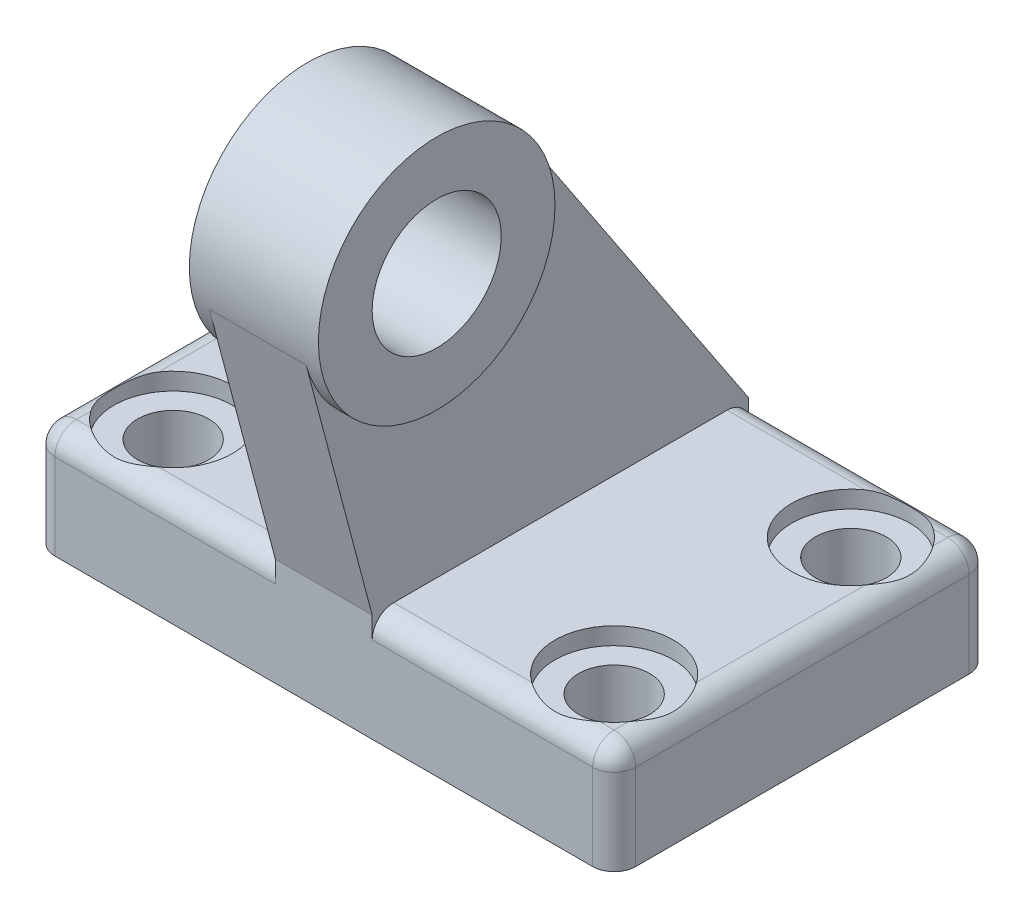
ISO-10303-21;
HEADER;
FILE_DESCRIPTION(('STEP AP214'),'2;1');
FILE_NAME('part.step','',(''),(''),'','','');
FILE_SCHEMA(('AUTOMOTIVE_DESIGN { 1 0 10303 214 1 1 1 1 }'));
ENDSEC;
DATA;
#1=APPLICATION_CONTEXT('core data for automotive mechanical design processes');
#2=APPLICATION_PROTOCOL_DEFINITION('international standard','automotive_design',2000,#1);
#3=PRODUCT_CONTEXT('',#1,'mechanical');
#4=PRODUCT('Part','Part','',(#3));
#5=PRODUCT_RELATED_PRODUCT_CATEGORY('part','',(#4));
#6=PRODUCT_DEFINITION_FORMATION('','',#4);
#7=PRODUCT_DEFINITION_CONTEXT('part definition',#1,'design');
#8=PRODUCT_DEFINITION('design','',#6,#7);
#9=PRODUCT_DEFINITION_SHAPE('','',#8);
#10=(LENGTH_UNIT() NAMED_UNIT(*) SI_UNIT(.MILLI.,.METRE.));
#11=(NAMED_UNIT(*) PLANE_ANGLE_UNIT() SI_UNIT($,.RADIAN.));
#12=(NAMED_UNIT(*) SI_UNIT($,.STERADIAN.) SOLID_ANGLE_UNIT());
#13=UNCERTAINTY_MEASURE_WITH_UNIT(LENGTH_MEASURE(1.E-05),#10,'distance_accuracy_value','');
#14=(GEOMETRIC_REPRESENTATION_CONTEXT(3) GLOBAL_UNCERTAINTY_ASSIGNED_CONTEXT((#13)) GLOBAL_UNIT_ASSIGNED_CONTEXT((#10,
#11,#12)) REPRESENTATION_CONTEXT('',''));
#15=CARTESIAN_POINT('',(0.,0.,0.));
#16=DIRECTION('',(0.,0.,1.));
#17=DIRECTION('',(1.,0.,0.));
#18=AXIS2_PLACEMENT_3D('',#15,#16,#17);
#19=CARTESIAN_POINT('',(4.5,36.,-4.5));
#20=DIRECTION('',(-1.,0.,0.));
#21=DIRECTION('',(0.,0.,1.));
#22=AXIS2_PLACEMENT_3D('',#19,#20,#21);
#23=CYLINDRICAL_SURFACE('',#22,6.);
#24=CARTESIAN_POINT('',(-6.,36.,-4.5));
#25=DIRECTION('',(-1.,0.,0.));
#26=DIRECTION('',(0.,0.,1.));
#27=AXIS2_PLACEMENT_3D('',#24,#25,#26);
#28=CIRCLE('',#27,6.);
#29=CARTESIAN_POINT('',(-6.,36.,1.5));
#30=VERTEX_POINT('',#29);
#31=EDGE_CURVE('E637',#30,#30,#28,.T.);
#32=ORIENTED_EDGE('',*,*,#31,.T.);
#33=EDGE_LOOP('',(#32));
#34=FACE_BOUND('',#33,.T.);
#35=CARTESIAN_POINT('',(6.,36.,-4.5));
#36=DIRECTION('',(-1.,0.,0.));
#37=DIRECTION('',(0.,0.,1.));
#38=AXIS2_PLACEMENT_3D('',#35,#36,#37);
#39=CIRCLE('',#38,6.);
#40=CARTESIAN_POINT('',(6.,36.,1.5));
#41=VERTEX_POINT('',#40);
#42=EDGE_CURVE('E20',#41,#41,#39,.T.);
#43=ORIENTED_EDGE('',*,*,#42,.F.);
#44=EDGE_LOOP('',(#43));
#45=FACE_BOUND('',#44,.T.);
#46=ADVANCED_FACE('F16',(#34,#45),#23,.F.);
#47=CARTESIAN_POINT('',(27.,10.,0.));
#48=DIRECTION('',(0.,-1.,0.));
#49=DIRECTION('',(0.,0.,-1.));
#50=AXIS2_PLACEMENT_3D('',#47,#48,#49);
#51=PLANE('',#50);
#52=CARTESIAN_POINT('',(20.5,10.,-6.50000000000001));
#53=DIRECTION('',(0.,1.,0.));
#54=DIRECTION('',(0.,0.,1.));
#55=AXIS2_PLACEMENT_3D('',#52,#53,#54);
#56=CIRCLE('',#55,5.5);
#57=CARTESIAN_POINT('',(25.,10.,-3.33772233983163));
#58=VERTEX_POINT('',#57);
#59=CARTESIAN_POINT('',(23.6622776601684,10.,-2.));
#60=VERTEX_POINT('',#59);
#61=EDGE_CURVE('E153',#58,#60,#56,.F.);
#62=ORIENTED_EDGE('',*,*,#61,.T.);
#63=DIRECTION('',(1.,0.,0.));
#64=VECTOR('',#63,1.);
#65=CARTESIAN_POINT('',(27.,10.,-2.));
#66=LINE('',#65,#64);
#67=CARTESIAN_POINT('',(25.,10.,-1.99999999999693));
#68=VERTEX_POINT('',#67);
#69=EDGE_CURVE('E157',#68,#60,#66,.F.);
#70=ORIENTED_EDGE('',*,*,#69,.F.);
#71=DIRECTION('',(0.,0.,-1.));
#72=VECTOR('',#71,1.);
#73=CARTESIAN_POINT('',(25.,10.,0.));
#74=LINE('',#73,#72);
#75=EDGE_CURVE('E150',#58,#68,#74,.F.);
#76=ORIENTED_EDGE('',*,*,#75,.F.);
#77=EDGE_LOOP('',(#62,#70,#76));
#78=FACE_BOUND('',#77,.T.);
#79=ADVANCED_FACE('F152',(#78),#51,.F.);
#80=CARTESIAN_POINT('',(27.,10.,0.));
#81=DIRECTION('',(0.,-1.,0.));
#82=DIRECTION('',(0.,0.,-1.));
#83=AXIS2_PLACEMENT_3D('',#80,#81,#82);
#84=PLANE('',#83);
#85=CARTESIAN_POINT('',(20.5,10.,-28.5));
#86=DIRECTION('',(0.,1.,0.));
#87=DIRECTION('',(0.,0.,1.));
#88=AXIS2_PLACEMENT_3D('',#85,#86,#87);
#89=CIRCLE('',#88,5.5);
#90=CARTESIAN_POINT('',(23.6622776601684,10.,-33.));
#91=VERTEX_POINT('',#90);
#92=CARTESIAN_POINT('',(25.,10.,-31.6622776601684));
#93=VERTEX_POINT('',#92);
#94=EDGE_CURVE('E170',#91,#93,#89,.F.);
#95=ORIENTED_EDGE('',*,*,#94,.T.);
#96=DIRECTION('',(0.,0.,-1.));
#97=VECTOR('',#96,1.);
#98=CARTESIAN_POINT('',(25.,10.,0.));
#99=LINE('',#98,#97);
#100=CARTESIAN_POINT('',(25.,10.,-33.));
#101=VERTEX_POINT('',#100);
#102=EDGE_CURVE('E162',#101,#93,#99,.F.);
#103=ORIENTED_EDGE('',*,*,#102,.F.);
#104=DIRECTION('',(1.,0.,0.));
#105=VECTOR('',#104,1.);
#106=CARTESIAN_POINT('',(27.,10.,-33.));
#107=LINE('',#106,#105);
#108=EDGE_CURVE('E626',#91,#101,#107,.T.);
#109=ORIENTED_EDGE('',*,*,#108,.F.);
#110=EDGE_LOOP('',(#95,#103,#109));
#111=FACE_BOUND('',#110,.T.);
#112=ADVANCED_FACE('F624',(#111),#84,.F.);
#113=CARTESIAN_POINT('',(6.,36.,-4.5));
#114=DIRECTION('',(1.,0.,0.));
#115=DIRECTION('',(0.,0.,-1.));
#116=AXIS2_PLACEMENT_3D('',#113,#114,#115);
#117=PLANE('',#116);
#118=ORIENTED_EDGE('',*,*,#42,.T.);
#119=EDGE_LOOP('',(#118));
#120=FACE_BOUND('',#119,.T.);
#121=CARTESIAN_POINT('',(6.,36.,-4.5));
#122=DIRECTION('',(-1.,0.,0.));
#123=DIRECTION('',(0.,0.,1.));
#124=AXIS2_PLACEMENT_3D('',#121,#122,#123);
#125=CIRCLE('',#124,11.);
#126=CARTESIAN_POINT('',(6.,36.,6.5));
#127=VERTEX_POINT('',#126);
#128=EDGE_CURVE('E684',#127,#127,#125,.T.);
#129=ORIENTED_EDGE('',*,*,#128,.F.);
#130=EDGE_LOOP('',(#129));
#131=FACE_BOUND('',#130,.T.);
#132=ADVANCED_FACE('F701',(#120,#131),#117,.T.);
#133=CARTESIAN_POINT('',(-6.,36.,-4.5));
#134=DIRECTION('',(1.,0.,0.));
#135=DIRECTION('',(0.,0.,-1.));
#136=AXIS2_PLACEMENT_3D('',#133,#134,#135);
#137=PLANE('',#136);
#138=ORIENTED_EDGE('',*,*,#31,.F.);
#139=EDGE_LOOP('',(#138));
#140=FACE_BOUND('',#139,.T.);
#141=CARTESIAN_POINT('',(-6.,36.,-4.5));
#142=DIRECTION('',(-1.,0.,0.));
#143=DIRECTION('',(0.,0.,1.));
#144=AXIS2_PLACEMENT_3D('',#141,#142,#143);
#145=CIRCLE('',#144,11.);
#146=CARTESIAN_POINT('',(-6.,36.,6.5));
#147=VERTEX_POINT('',#146);
#148=EDGE_CURVE('E681',#147,#147,#145,.F.);
#149=ORIENTED_EDGE('',*,*,#148,.F.);
#150=EDGE_LOOP('',(#149));
#151=FACE_BOUND('',#150,.T.);
#152=ADVANCED_FACE('F697',(#140,#151),#137,.F.);
#153=CARTESIAN_POINT('',(27.,10.,0.));
#154=DIRECTION('',(0.,-1.,0.));
#155=DIRECTION('',(0.,0.,-1.));
#156=AXIS2_PLACEMENT_3D('',#153,#154,#155);
#157=PLANE('',#156);
#158=CARTESIAN_POINT('',(-20.5,10.,-28.5));
#159=DIRECTION('',(0.,1.,0.));
#160=DIRECTION('',(0.,0.,1.));
#161=AXIS2_PLACEMENT_3D('',#158,#159,#160);
#162=CIRCLE('',#161,5.49999999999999);
#163=CARTESIAN_POINT('',(-25.,10.,-31.6622776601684));
#164=VERTEX_POINT('',#163);
#165=CARTESIAN_POINT('',(-23.6622776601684,10.,-33.));
#166=VERTEX_POINT('',#165);
#167=EDGE_CURVE('E663',#164,#166,#162,.F.);
#168=ORIENTED_EDGE('',*,*,#167,.T.);
#169=DIRECTION('',(1.,0.,0.));
#170=VECTOR('',#169,1.);
#171=CARTESIAN_POINT('',(27.,10.,-33.));
#172=LINE('',#171,#170);
#173=CARTESIAN_POINT('',(-25.,10.,-33.));
#174=VERTEX_POINT('',#173);
#175=EDGE_CURVE('E648',#174,#166,#172,.T.);
#176=ORIENTED_EDGE('',*,*,#175,.F.);
#177=DIRECTION('',(0.,0.,-1.));
#178=VECTOR('',#177,1.);
#179=CARTESIAN_POINT('',(-25.,10.,0.));
#180=LINE('',#179,#178);
#181=EDGE_CURVE('E548',#164,#174,#180,.T.);
#182=ORIENTED_EDGE('',*,*,#181,.F.);
#183=EDGE_LOOP('',(#168,#176,#182));
#184=FACE_BOUND('',#183,.T.);
#185=ADVANCED_FACE('F700',(#184),#157,.F.);
#186=CARTESIAN_POINT('',(27.,10.,0.));
#187=DIRECTION('',(0.,-1.,0.));
#188=DIRECTION('',(0.,0.,-1.));
#189=AXIS2_PLACEMENT_3D('',#186,#187,#188);
#190=PLANE('',#189);
#191=CARTESIAN_POINT('',(-20.5,10.,-6.50000000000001));
#192=DIRECTION('',(0.,1.,0.));
#193=DIRECTION('',(0.,0.,1.));
#194=AXIS2_PLACEMENT_3D('',#191,#192,#193);
#195=CIRCLE('',#194,5.5);
#196=CARTESIAN_POINT('',(-23.6622776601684,10.,-2.));
#197=VERTEX_POINT('',#196);
#198=CARTESIAN_POINT('',(-25.,10.,-3.33772233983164));
#199=VERTEX_POINT('',#198);
#200=EDGE_CURVE('E660',#197,#199,#195,.F.);
#201=ORIENTED_EDGE('',*,*,#200,.T.);
#202=DIRECTION('',(0.,0.,-1.));
#203=VECTOR('',#202,1.);
#204=CARTESIAN_POINT('',(-25.,10.,0.));
#205=LINE('',#204,#203);
#206=CARTESIAN_POINT('',(-25.,10.,-2.));
#207=VERTEX_POINT('',#206);
#208=EDGE_CURVE('E647',#207,#199,#205,.T.);
#209=ORIENTED_EDGE('',*,*,#208,.F.);
#210=DIRECTION('',(1.,0.,0.));
#211=VECTOR('',#210,1.);
#212=CARTESIAN_POINT('',(27.,10.,-2.));
#213=LINE('',#212,#211);
#214=EDGE_CURVE('E171',#197,#207,#213,.F.);
#215=ORIENTED_EDGE('',*,*,#214,.F.);
#216=EDGE_LOOP('',(#201,#209,#215));
#217=FACE_BOUND('',#216,.T.);
#218=ADVANCED_FACE('F661',(#217),#190,.F.);
#219=CARTESIAN_POINT('',(20.5,8.4,-6.50000000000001));
#220=DIRECTION('',(0.,1.,0.));
#221=DIRECTION('',(0.,0.,1.));
#222=AXIS2_PLACEMENT_3D('',#219,#220,#221);
#223=CYLINDRICAL_SURFACE('',#222,5.5);
#224=CARTESIAN_POINT('',(20.5,8.4,-6.50000000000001));
#225=DIRECTION('',(0.,1.,0.));
#226=DIRECTION('',(0.,0.,1.));
#227=AXIS2_PLACEMENT_3D('',#224,#225,#226);
#228=CIRCLE('',#227,5.5);
#229=CARTESIAN_POINT('',(20.5,8.4,-1.00000000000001));
#230=VERTEX_POINT('',#229);
#231=EDGE_CURVE('E388',#230,#230,#228,.T.);
#232=ORIENTED_EDGE('',*,*,#231,.F.);
#233=EDGE_LOOP('',(#232));
#234=FACE_BOUND('',#233,.T.);
#235=CARTESIAN_POINT('',(20.5,10.,-6.50000000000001));
#236=DIRECTION('',(0.,1.,0.));
#237=DIRECTION('',(0.,0.,1.));
#238=AXIS2_PLACEMENT_3D('',#235,#236,#237);
#239=CIRCLE('',#238,5.5);
#240=CARTESIAN_POINT('',(25.,10.,-9.66227766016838));
#241=VERTEX_POINT('',#240);
#242=CARTESIAN_POINT('',(17.3377223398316,10.,-2.));
#243=VERTEX_POINT('',#242);
#244=EDGE_CURVE('E687',#241,#243,#239,.T.);
#245=ORIENTED_EDGE('',*,*,#244,.T.);
#246=CARTESIAN_POINT('',(23.6622776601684,10.,-2.));
#247=CARTESIAN_POINT('',(23.5532575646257,9.99995273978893,-1.92337219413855));
#248=CARTESIAN_POINT('',(23.4415505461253,9.99560129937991,-1.85080659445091));
#249=CARTESIAN_POINT('',(23.2136349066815,9.98067722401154,-1.71421181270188));
#250=CARTESIAN_POINT('',(23.0974331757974,9.97011378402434,-1.65017018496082));
#251=CARTESIAN_POINT('',(22.8605097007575,9.94507904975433,-1.53052214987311));
#252=CARTESIAN_POINT('',(22.7397690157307,9.93058932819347,-1.47495750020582));
#253=CARTESIAN_POINT('',(22.4947275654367,9.89984439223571,-1.37275021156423));
#254=CARTESIAN_POINT('',(22.3704251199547,9.88358833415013,-1.32611186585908));
#255=CARTESIAN_POINT('',(22.1045192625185,9.84949095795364,-1.23717475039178));
#256=CARTESIAN_POINT('',(21.9625476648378,9.83167800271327,-1.1959613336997));
#257=CARTESIAN_POINT('',(21.6754409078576,9.79888158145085,-1.12503982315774));
#258=CARTESIAN_POINT('',(21.5303060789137,9.78389782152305,-1.09533053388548));
#259=CARTESIAN_POINT('',(21.2382623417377,9.7589740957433,-1.0477745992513));
#260=CARTESIAN_POINT('',(21.0913629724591,9.74901399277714,-1.02988050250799));
#261=CARTESIAN_POINT('',(20.7963069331,9.73555370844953,-1.00599426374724));
#262=CARTESIAN_POINT('',(20.6481504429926,9.73205261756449,-1.00000044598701));
#263=CARTESIAN_POINT('',(20.3620475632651,9.73204912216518,-0.99999958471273));
#264=CARTESIAN_POINT('',(20.224100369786,9.73508154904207,-1.00519582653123));
#265=CARTESIAN_POINT('',(19.9492333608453,9.74679419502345,-1.02591075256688));
#266=CARTESIAN_POINT('',(19.8123135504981,9.75547444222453,-1.04142948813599));
#267=CARTESIAN_POINT('',(19.5398661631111,9.77738382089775,-1.08269405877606));
#268=CARTESIAN_POINT('',(19.4043459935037,9.79063036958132,-1.10847911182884));
#269=CARTESIAN_POINT('',(19.1359125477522,9.81999017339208,-1.1700624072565));
#270=CARTESIAN_POINT('',(19.0029996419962,9.83610383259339,-1.20586206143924));
#271=CARTESIAN_POINT('',(18.7352077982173,9.86985883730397,-1.28886602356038));
#272=CARTESIAN_POINT('',(18.6004541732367,9.88753524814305,-1.33646048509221));
#273=CARTESIAN_POINT('',(18.3349468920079,9.92139385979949,-1.44204082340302));
#274=CARTESIAN_POINT('',(18.2041917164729,9.93757663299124,-1.50002269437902));
#275=CARTESIAN_POINT('',(17.9477330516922,9.9657678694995,-1.62596256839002));
#276=CARTESIAN_POINT('',(17.8220107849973,9.97779344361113,-1.69387800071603));
#277=CARTESIAN_POINT('',(17.6373494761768,9.99062759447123,-1.80315408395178));
#278=CARTESIAN_POINT('',(17.5764015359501,9.99403892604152,-1.84084686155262));
#279=CARTESIAN_POINT('',(17.4559457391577,9.99872358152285,-1.91863794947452));
#280=CARTESIAN_POINT('',(17.3964384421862,9.99999608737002,-1.95873717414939));
#281=CARTESIAN_POINT('',(17.3377223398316,10.0000000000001,-1.99999999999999));
#282=B_SPLINE_CURVE_WITH_KNOTS('',3,(#246,#247,#248,#249,#250,#251,#252,#253,#254,#255,#256,
#257,#258,#259,#260,#261,#262,#263,#264,#265,#266,#267,#268,#269,#270,#271,#272,#273,#274,#275,
#276,#277,#278,#279,#280,#281),.UNSPECIFIED.,.F.,.F.,(4,2,2,2,2,2,2,2,2,2,2,2,2,2,2,2,2,4),(0.,
0.399418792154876,0.798247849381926,1.19898216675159,1.59990874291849,2.04612536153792,
2.4922956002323,2.93666288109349,3.38096758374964,3.79468836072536,4.20841119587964,
4.62372987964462,5.03910714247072,5.47067560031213,5.9020779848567,6.33168298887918,
6.54683489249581,6.76206906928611),.UNSPECIFIED.);
#283=EDGE_CURVE('E169',#60,#243,#282,.T.);
#284=ORIENTED_EDGE('',*,*,#283,.F.);
#285=ORIENTED_EDGE('',*,*,#61,.F.);
#286=CARTESIAN_POINT('',(25.,10.,-9.66227766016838));
#287=CARTESIAN_POINT('',(25.0766478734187,9.99995268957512,-9.55322909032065));
#288=CARTESIAN_POINT('',(25.1492314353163,9.99559899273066,-9.44149204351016));
#289=CARTESIAN_POINT('',(25.285860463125,9.98066746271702,-9.21350937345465));
#290=CARTESIAN_POINT('',(25.3499180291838,9.97009856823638,-9.09727044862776));
#291=CARTESIAN_POINT('',(25.4695586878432,9.94505888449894,-8.86033759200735));
#292=CARTESIAN_POINT('',(25.5251049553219,9.93057185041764,-8.73962696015));
#293=CARTESIAN_POINT('',(25.6272782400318,9.89983452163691,-8.49465166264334));
#294=CARTESIAN_POINT('',(25.6739013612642,9.88358346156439,-8.37038547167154));
#295=CARTESIAN_POINT('',(25.7607578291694,9.85028336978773,-8.11070058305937));
#296=CARTESIAN_POINT('',(25.8003890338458,9.83325006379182,-7.97507797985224));
#297=CARTESIAN_POINT('',(25.8691500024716,9.80166938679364,-7.70091468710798));
#298=CARTESIAN_POINT('',(25.8982808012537,9.78712177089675,-7.56237428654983));
#299=CARTESIAN_POINT('',(25.9457240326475,9.76247625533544,-7.28358332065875));
#300=CARTESIAN_POINT('',(25.9640767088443,9.75236183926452,-7.14334113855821));
#301=CARTESIAN_POINT('',(25.9899259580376,9.73789224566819,-6.86155963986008));
#302=CARTESIAN_POINT('',(25.9974232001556,9.73353671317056,-6.72002040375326));
#303=CARTESIAN_POINT('',(26.0015172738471,9.73117642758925,-6.43270312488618));
#304=CARTESIAN_POINT('',(25.9977984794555,9.73335555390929,-6.28691886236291));
#305=CARTESIAN_POINT('',(25.9788261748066,9.74413707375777,-5.99634464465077));
#306=CARTESIAN_POINT('',(25.9635717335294,9.75273998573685,-5.85155477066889));
#307=CARTESIAN_POINT('',(25.921638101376,9.77514661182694,-5.56345082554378));
#308=CARTESIAN_POINT('',(25.8949117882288,9.78897174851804,-5.42014536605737));
#309=CARTESIAN_POINT('',(25.8302774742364,9.81986767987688,-5.13643177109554));
#310=CARTESIAN_POINT('',(25.7923678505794,9.83693894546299,-4.99602405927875));
#311=CARTESIAN_POINT('',(25.7066764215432,9.87154696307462,-4.72219557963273));
#312=CARTESIAN_POINT('',(25.6591628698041,9.88906165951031,-4.58868789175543));
#313=CARTESIAN_POINT('',(25.5539254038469,9.92255438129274,-4.32562637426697));
#314=CARTESIAN_POINT('',(25.4962060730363,9.93853309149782,-4.19607080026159));
#315=CARTESIAN_POINT('',(25.3710054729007,9.96632852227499,-3.9420224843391));
#316=CARTESIAN_POINT('',(25.3035722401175,9.97816479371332,-3.81750848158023));
#317=CARTESIAN_POINT('',(25.1951539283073,9.99078884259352,-3.63459127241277));
#318=CARTESIAN_POINT('',(25.1577689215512,9.99414244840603,-3.5742125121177));
#319=CARTESIAN_POINT('',(25.0806373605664,9.99874653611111,-3.45487052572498));
#320=CARTESIAN_POINT('',(25.040889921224,9.99999622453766,-3.39590784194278));
#321=CARTESIAN_POINT('',(25.,10.,-3.33772233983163));
#322=B_SPLINE_CURVE_WITH_KNOTS('',3,(#286,#287,#288,#289,#290,#291,#292,#293,#294,#295,#296,
#297,#298,#299,#300,#301,#302,#303,#304,#305,#306,#307,#308,#309,#310,#311,#312,#313,#314,#315,
#316,#317,#318,#319,#320,#321),.UNSPECIFIED.,.F.,.F.,(4,2,2,2,2,2,2,2,2,2,2,2,2,2,2,2,2,4),(0.,
0.399523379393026,0.798473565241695,1.19910387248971,1.59990870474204,2.02643726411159,
2.45292377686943,2.87780757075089,3.30266517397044,3.73958900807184,4.1765481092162,
4.61531951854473,5.05415462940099,5.48210261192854,5.90985888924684,6.33556818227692,
6.54877812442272,6.76206845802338),.UNSPECIFIED.);
#323=EDGE_CURVE('E168',#241,#58,#322,.T.);
#324=ORIENTED_EDGE('',*,*,#323,.F.);
#325=EDGE_LOOP('',(#245,#284,#285,#324));
#326=FACE_BOUND('',#325,.T.);
#327=ADVANCED_FACE('F167',(#234,#326),#223,.F.);
#328=CARTESIAN_POINT('',(20.5,8.4,-28.5));
#329=DIRECTION('',(0.,1.,0.));
#330=DIRECTION('',(0.,0.,1.));
#331=AXIS2_PLACEMENT_3D('',#328,#329,#330);
#332=CYLINDRICAL_SURFACE('',#331,5.5);
#333=CARTESIAN_POINT('',(17.3377223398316,10.,-33.));
#334=CARTESIAN_POINT('',(17.4467424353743,9.99995273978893,-33.0766278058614));
#335=CARTESIAN_POINT('',(17.5584494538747,9.99560129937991,-33.1491934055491));
#336=CARTESIAN_POINT('',(17.7863650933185,9.98067722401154,-33.2857881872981));
#337=CARTESIAN_POINT('',(17.9025668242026,9.97011378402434,-33.3498298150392));
#338=CARTESIAN_POINT('',(18.1394902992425,9.94507904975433,-33.4694778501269));
#339=CARTESIAN_POINT('',(18.2602309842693,9.93058932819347,-33.5250424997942));
#340=CARTESIAN_POINT('',(18.5052724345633,9.89984439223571,-33.6272497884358));
#341=CARTESIAN_POINT('',(18.6295748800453,9.88358833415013,-33.6738881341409));
#342=CARTESIAN_POINT('',(18.8954807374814,9.84949095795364,-33.7628252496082));
#343=CARTESIAN_POINT('',(19.0374523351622,9.83167800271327,-33.8040386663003));
#344=CARTESIAN_POINT('',(19.3245590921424,9.79888158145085,-33.8749601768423));
#345=CARTESIAN_POINT('',(19.4696939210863,9.78389782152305,-33.9046694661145));
#346=CARTESIAN_POINT('',(19.7617376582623,9.75897409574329,-33.9522254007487));
#347=CARTESIAN_POINT('',(19.9086370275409,9.74901399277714,-33.970119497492));
#348=CARTESIAN_POINT('',(20.2036930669,9.73555370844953,-33.9940057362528));
#349=CARTESIAN_POINT('',(20.3518495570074,9.73205261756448,-33.999999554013));
#350=CARTESIAN_POINT('',(20.6379524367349,9.73204912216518,-34.0000004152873));
#351=CARTESIAN_POINT('',(20.775899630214,9.73508154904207,-33.9948041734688));
#352=CARTESIAN_POINT('',(21.0507666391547,9.74679419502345,-33.9740892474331));
#353=CARTESIAN_POINT('',(21.1876864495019,9.75547444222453,-33.958570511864));
#354=CARTESIAN_POINT('',(21.460133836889,9.77738382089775,-33.917305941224));
#355=CARTESIAN_POINT('',(21.5956540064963,9.79063036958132,-33.8915208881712));
#356=CARTESIAN_POINT('',(21.8640874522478,9.81999017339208,-33.8299375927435));
#357=CARTESIAN_POINT('',(21.9970003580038,9.83610383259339,-33.7941379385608));
#358=CARTESIAN_POINT('',(22.2647922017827,9.86985883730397,-33.7111339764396));
#359=CARTESIAN_POINT('',(22.3995458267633,9.88753524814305,-33.6635395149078));
#360=CARTESIAN_POINT('',(22.6650531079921,9.92139385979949,-33.557959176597));
#361=CARTESIAN_POINT('',(22.7958082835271,9.93757663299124,-33.499977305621));
#362=CARTESIAN_POINT('',(23.0522669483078,9.96576786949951,-33.37403743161));
#363=CARTESIAN_POINT('',(23.1779892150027,9.97779344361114,-33.306121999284));
#364=CARTESIAN_POINT('',(23.3626505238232,9.99062759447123,-33.1968459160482));
#365=CARTESIAN_POINT('',(23.42359846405,9.99403892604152,-33.1591531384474));
#366=CARTESIAN_POINT('',(23.5440542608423,9.99872358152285,-33.0813620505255));
#367=CARTESIAN_POINT('',(23.6035615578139,9.99999608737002,-33.0412628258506));
#368=CARTESIAN_POINT('',(23.6622776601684,10.0000000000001,-33.));
#369=B_SPLINE_CURVE_WITH_KNOTS('',3,(#333,#334,#335,#336,#337,#338,#339,#340,#341,#342,#343,
#344,#345,#346,#347,#348,#349,#350,#351,#352,#353,#354,#355,#356,#357,#358,#359,#360,#361,#362,
#363,#364,#365,#366,#367,#368),.UNSPECIFIED.,.F.,.F.,(4,2,2,2,2,2,2,2,2,2,2,2,2,2,2,2,2,4),(0.,
0.399418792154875,0.798247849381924,1.19898216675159,1.59990874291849,2.04612536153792,
2.49229560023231,2.93666288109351,3.38096758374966,3.79468836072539,4.20841119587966,
4.62372987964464,5.03910714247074,5.47067560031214,5.90207798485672,6.33168298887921,
6.54683489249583,6.76206906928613),.UNSPECIFIED.);
#370=CARTESIAN_POINT('',(17.3377223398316,10.,-33.));
#371=VERTEX_POINT('',#370);
#372=EDGE_CURVE('E226',#371,#91,#369,.T.);
#373=ORIENTED_EDGE('',*,*,#372,.F.);
#374=CARTESIAN_POINT('',(20.5,10.,-28.5));
#375=DIRECTION('',(0.,1.,0.));
#376=DIRECTION('',(0.,0.,1.));
#377=AXIS2_PLACEMENT_3D('',#374,#375,#376);
#378=CIRCLE('',#377,5.5);
#379=CARTESIAN_POINT('',(25.,10.,-25.3377223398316));
#380=VERTEX_POINT('',#379);
#381=EDGE_CURVE('E689',#371,#380,#378,.T.);
#382=ORIENTED_EDGE('',*,*,#381,.T.);
#383=CARTESIAN_POINT('',(25.,10.,-31.6622776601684));
#384=CARTESIAN_POINT('',(25.0766478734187,9.99995268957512,-31.5532290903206));
#385=CARTESIAN_POINT('',(25.1492314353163,9.99559899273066,-31.4414920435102));
#386=CARTESIAN_POINT('',(25.285860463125,9.98066746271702,-31.2135093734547));
#387=CARTESIAN_POINT('',(25.3499180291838,9.97009856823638,-31.0972704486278));
#388=CARTESIAN_POINT('',(25.4695586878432,9.94505888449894,-30.8603375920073));
#389=CARTESIAN_POINT('',(25.5251049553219,9.93057185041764,-30.73962696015));
#390=CARTESIAN_POINT('',(25.6272782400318,9.89983452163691,-30.4946516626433));
#391=CARTESIAN_POINT('',(25.6739013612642,9.88358346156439,-30.3703854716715));
#392=CARTESIAN_POINT('',(25.7607578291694,9.85028336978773,-30.1107005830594));
#393=CARTESIAN_POINT('',(25.8003890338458,9.83325006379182,-29.9750779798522));
#394=CARTESIAN_POINT('',(25.8691500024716,9.80166938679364,-29.700914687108));
#395=CARTESIAN_POINT('',(25.8982808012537,9.78712177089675,-29.5623742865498));
#396=CARTESIAN_POINT('',(25.9457240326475,9.76247625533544,-29.2835833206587));
#397=CARTESIAN_POINT('',(25.9640767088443,9.75236183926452,-29.1433411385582));
#398=CARTESIAN_POINT('',(25.9899259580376,9.73789224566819,-28.8615596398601));
#399=CARTESIAN_POINT('',(25.9974232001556,9.73353671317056,-28.7200204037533));
#400=CARTESIAN_POINT('',(26.0015172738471,9.73117642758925,-28.4327031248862));
#401=CARTESIAN_POINT('',(25.9977984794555,9.73335555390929,-28.2869188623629));
#402=CARTESIAN_POINT('',(25.9788261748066,9.74413707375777,-27.9963446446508));
#403=CARTESIAN_POINT('',(25.9635717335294,9.75273998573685,-27.8515547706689));
#404=CARTESIAN_POINT('',(25.921638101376,9.77514661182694,-27.5634508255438));
#405=CARTESIAN_POINT('',(25.8949117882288,9.78897174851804,-27.4201453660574));
#406=CARTESIAN_POINT('',(25.8302774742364,9.81986767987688,-27.1364317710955));
#407=CARTESIAN_POINT('',(25.7923678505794,9.83693894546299,-26.9960240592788));
#408=CARTESIAN_POINT('',(25.7066764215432,9.87154696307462,-26.7221955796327));
#409=CARTESIAN_POINT('',(25.6591628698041,9.88906165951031,-26.5886878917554));
#410=CARTESIAN_POINT('',(25.5539254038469,9.92255438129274,-26.325626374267));
#411=CARTESIAN_POINT('',(25.4962060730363,9.93853309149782,-26.1960708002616));
#412=CARTESIAN_POINT('',(25.3710054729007,9.96632852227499,-25.9420224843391));
#413=CARTESIAN_POINT('',(25.3035722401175,9.97816479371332,-25.8175084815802));
#414=CARTESIAN_POINT('',(25.1951539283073,9.99078884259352,-25.6345912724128));
#415=CARTESIAN_POINT('',(25.1577689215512,9.99414244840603,-25.5742125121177));
#416=CARTESIAN_POINT('',(25.0806373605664,9.99874653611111,-25.454870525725));
#417=CARTESIAN_POINT('',(25.040889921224,9.99999622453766,-25.3959078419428));
#418=CARTESIAN_POINT('',(25.,10.,-25.3377223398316));
#419=B_SPLINE_CURVE_WITH_KNOTS('',3,(#383,#384,#385,#386,#387,#388,#389,#390,#391,#392,#393,
#394,#395,#396,#397,#398,#399,#400,#401,#402,#403,#404,#405,#406,#407,#408,#409,#410,#411,#412,
#413,#414,#415,#416,#417,#418),.UNSPECIFIED.,.F.,.F.,(4,2,2,2,2,2,2,2,2,2,2,2,2,2,2,2,2,4),(0.,
0.399523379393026,0.798473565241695,1.19910387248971,1.59990870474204,2.02643726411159,
2.45292377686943,2.87780757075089,3.30266517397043,3.73958900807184,4.17654810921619,
4.61531951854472,5.05415462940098,5.48210261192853,5.90985888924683,6.33556818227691,
6.54877812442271,6.76206845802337),.UNSPECIFIED.);
#420=EDGE_CURVE('E180',#93,#380,#419,.T.);
#421=ORIENTED_EDGE('',*,*,#420,.F.);
#422=ORIENTED_EDGE('',*,*,#94,.F.);
#423=EDGE_LOOP('',(#373,#382,#421,#422));
#424=FACE_BOUND('',#423,.T.);
#425=CARTESIAN_POINT('',(20.5,8.4,-28.5));
#426=DIRECTION('',(0.,1.,0.));
#427=DIRECTION('',(0.,0.,1.));
#428=AXIS2_PLACEMENT_3D('',#425,#426,#427);
#429=CIRCLE('',#428,5.5);
#430=CARTESIAN_POINT('',(20.5,8.4,-23.));
#431=VERTEX_POINT('',#430);
#432=EDGE_CURVE('E672',#431,#431,#429,.T.);
#433=ORIENTED_EDGE('',*,*,#432,.F.);
#434=EDGE_LOOP('',(#433));
#435=FACE_BOUND('',#434,.T.);
#436=ADVANCED_FACE('F810',(#424,#435),#332,.F.);
#437=CARTESIAN_POINT('',(27.,10.,0.));
#438=DIRECTION('',(0.,-1.,0.));
#439=DIRECTION('',(0.,0.,-1.));
#440=AXIS2_PLACEMENT_3D('',#437,#438,#439);
#441=PLANE('',#440);
#442=ORIENTED_EDGE('',*,*,#244,.F.);
#443=DIRECTION('',(0.,0.,-1.));
#444=VECTOR('',#443,1.);
#445=CARTESIAN_POINT('',(25.,10.,0.));
#446=LINE('',#445,#444);
#447=EDGE_CURVE('E176',#380,#241,#446,.F.);
#448=ORIENTED_EDGE('',*,*,#447,.F.);
#449=ORIENTED_EDGE('',*,*,#381,.F.);
#450=DIRECTION('',(-1.,0.,0.));
#451=VECTOR('',#450,1.);
#452=CARTESIAN_POINT('',(27.,10.,-33.));
#453=LINE('',#452,#451);
#454=CARTESIAN_POINT('',(4.5,10.,-33.));
#455=VERTEX_POINT('',#454);
#456=EDGE_CURVE('E223',#455,#371,#453,.F.);
#457=ORIENTED_EDGE('',*,*,#456,.F.);
#458=DIRECTION('',(0.,0.,1.));
#459=VECTOR('',#458,1.);
#460=CARTESIAN_POINT('',(4.5,10.,-4.5));
#461=LINE('',#460,#459);
#462=CARTESIAN_POINT('',(4.5,10.,-2.));
#463=VERTEX_POINT('',#462);
#464=EDGE_CURVE('E235',#455,#463,#461,.T.);
#465=ORIENTED_EDGE('',*,*,#464,.T.);
#466=DIRECTION('',(-1.,0.,0.));
#467=VECTOR('',#466,1.);
#468=CARTESIAN_POINT('',(27.,10.,-2.));
#469=LINE('',#468,#467);
#470=EDGE_CURVE('E344',#243,#463,#469,.T.);
#471=ORIENTED_EDGE('',*,*,#470,.F.);
#472=EDGE_LOOP('',(#442,#448,#449,#457,#465,#471));
#473=FACE_BOUND('',#472,.T.);
#474=ADVANCED_FACE('F707',(#473),#441,.F.);
#475=CARTESIAN_POINT('',(4.5,36.,-4.5));
#476=DIRECTION('',(-1.,0.,0.));
#477=DIRECTION('',(0.,0.,1.));
#478=AXIS2_PLACEMENT_3D('',#475,#476,#477);
#479=CYLINDRICAL_SURFACE('',#478,11.);
#480=CARTESIAN_POINT('',(4.5,36.,-4.5));
#481=DIRECTION('',(-1.,0.,0.));
#482=DIRECTION('',(0.,0.,1.));
#483=AXIS2_PLACEMENT_3D('',#480,#481,#482);
#484=CIRCLE('',#483,11.);
#485=CARTESIAN_POINT('',(4.5,33.1866805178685,6.13415410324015));
#486=VERTEX_POINT('',#485);
#487=CARTESIAN_POINT('',(4.5,42.0910909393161,-13.6596185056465));
#488=VERTEX_POINT('',#487);
#489=EDGE_CURVE('E231',#486,#488,#484,.F.);
#490=ORIENTED_EDGE('',*,*,#489,.T.);
#491=DIRECTION('',(1.,0.,0.));
#492=VECTOR('',#491,1.);
#493=CARTESIAN_POINT('',(4.5,42.0910909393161,-13.6596185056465));
#494=LINE('',#493,#492);
#495=CARTESIAN_POINT('',(-4.5,42.0910909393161,-13.6596185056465));
#496=VERTEX_POINT('',#495);
#497=EDGE_CURVE('E251',#488,#496,#494,.F.);
#498=ORIENTED_EDGE('',*,*,#497,.T.);
#499=CARTESIAN_POINT('',(-4.5,36.,-4.5));
#500=DIRECTION('',(-1.,0.,0.));
#501=DIRECTION('',(0.,0.,1.));
#502=AXIS2_PLACEMENT_3D('',#499,#500,#501);
#503=CIRCLE('',#502,11.);
#504=CARTESIAN_POINT('',(-4.5,33.1866805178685,6.13415410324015));
#505=VERTEX_POINT('',#504);
#506=EDGE_CURVE('E245',#505,#496,#503,.F.);
#507=ORIENTED_EDGE('',*,*,#506,.F.);
#508=DIRECTION('',(1.,0.,0.));
#509=VECTOR('',#508,1.);
#510=CARTESIAN_POINT('',(4.5,33.1866805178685,6.13415410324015));
#511=LINE('',#510,#509);
#512=EDGE_CURVE('E346',#505,#486,#511,.T.);
#513=ORIENTED_EDGE('',*,*,#512,.T.);
#514=EDGE_LOOP('',(#490,#498,#507,#513));
#515=FACE_BOUND('',#514,.T.);
#516=ORIENTED_EDGE('',*,*,#148,.T.);
#517=EDGE_LOOP('',(#516));
#518=FACE_BOUND('',#517,.T.);
#519=ORIENTED_EDGE('',*,*,#128,.T.);
#520=EDGE_LOOP('',(#519));
#521=FACE_BOUND('',#520,.T.);
#522=ADVANCED_FACE('F303',(#515,#518,#521),#479,.T.);
#523=CARTESIAN_POINT('',(-20.5,8.4,-28.5));
#524=DIRECTION('',(0.,1.,0.));
#525=DIRECTION('',(0.,0.,1.));
#526=AXIS2_PLACEMENT_3D('',#523,#524,#525);
#527=CYLINDRICAL_SURFACE('',#526,5.49999999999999);
#528=CARTESIAN_POINT('',(-25.,10.,-25.3377223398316));
#529=CARTESIAN_POINT('',(-25.0766478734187,9.99995268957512,-25.4467709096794));
#530=CARTESIAN_POINT('',(-25.1492314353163,9.99559899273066,-25.5585079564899));
#531=CARTESIAN_POINT('',(-25.2858604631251,9.98066746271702,-25.7864906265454));
#532=CARTESIAN_POINT('',(-25.3499180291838,9.97009856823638,-25.9027295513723));
#533=CARTESIAN_POINT('',(-25.4695586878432,9.94505888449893,-26.1396624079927));
#534=CARTESIAN_POINT('',(-25.5251049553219,9.93057185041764,-26.26037303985));
#535=CARTESIAN_POINT('',(-25.6272782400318,9.8998345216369,-26.5053483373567));
#536=CARTESIAN_POINT('',(-25.6739013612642,9.88358346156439,-26.6296145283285));
#537=CARTESIAN_POINT('',(-25.7607578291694,9.85028336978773,-26.8892994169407));
#538=CARTESIAN_POINT('',(-25.8003890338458,9.83325006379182,-27.0249220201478));
#539=CARTESIAN_POINT('',(-25.8691500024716,9.80166938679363,-27.2990853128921));
#540=CARTESIAN_POINT('',(-25.8982808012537,9.78712177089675,-27.4376257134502));
#541=CARTESIAN_POINT('',(-25.9457240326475,9.76247625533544,-27.7164166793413));
#542=CARTESIAN_POINT('',(-25.9640767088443,9.75236183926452,-27.8566588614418));
#543=CARTESIAN_POINT('',(-25.9899259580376,9.73789224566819,-28.1384403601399));
#544=CARTESIAN_POINT('',(-25.9974232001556,9.73353671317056,-28.2799795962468));
#545=CARTESIAN_POINT('',(-26.0015172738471,9.73117642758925,-28.5672968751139));
#546=CARTESIAN_POINT('',(-25.9977984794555,9.73335555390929,-28.7130811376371));
#547=CARTESIAN_POINT('',(-25.9788261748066,9.74413707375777,-29.0036553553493));
#548=CARTESIAN_POINT('',(-25.9635717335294,9.75273998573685,-29.1484452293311));
#549=CARTESIAN_POINT('',(-25.921638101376,9.77514661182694,-29.4365491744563));
#550=CARTESIAN_POINT('',(-25.8949117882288,9.78897174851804,-29.5798546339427));
#551=CARTESIAN_POINT('',(-25.8302774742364,9.81986767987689,-29.8635682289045));
#552=CARTESIAN_POINT('',(-25.7923678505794,9.836938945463,-30.0039759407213));
#553=CARTESIAN_POINT('',(-25.7066764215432,9.87154696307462,-30.2778044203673));
#554=CARTESIAN_POINT('',(-25.6591628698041,9.88906165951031,-30.4113121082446));
#555=CARTESIAN_POINT('',(-25.5539254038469,9.92255438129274,-30.674373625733));
#556=CARTESIAN_POINT('',(-25.4962060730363,9.93853309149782,-30.8039291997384));
#557=CARTESIAN_POINT('',(-25.3710054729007,9.96632852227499,-31.0579775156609));
#558=CARTESIAN_POINT('',(-25.3035722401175,9.97816479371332,-31.1824915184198));
#559=CARTESIAN_POINT('',(-25.1951539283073,9.99078884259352,-31.3654087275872));
#560=CARTESIAN_POINT('',(-25.1577689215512,9.99414244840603,-31.4257874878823));
#561=CARTESIAN_POINT('',(-25.0806373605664,9.99874653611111,-31.545129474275));
#562=CARTESIAN_POINT('',(-25.040889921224,9.99999622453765,-31.6040921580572));
#563=CARTESIAN_POINT('',(-25.,10.,-31.6622776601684));
#564=B_SPLINE_CURVE_WITH_KNOTS('',3,(#528,#529,#530,#531,#532,#533,#534,#535,#536,#537,#538,
#539,#540,#541,#542,#543,#544,#545,#546,#547,#548,#549,#550,#551,#552,#553,#554,#555,#556,#557,
#558,#559,#560,#561,#562,#563),.UNSPECIFIED.,.F.,.F.,(4,2,2,2,2,2,2,2,2,2,2,2,2,2,2,2,2,4),(0.,
0.399523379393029,0.798473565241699,1.19910387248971,1.59990870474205,2.02643726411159,
2.45292377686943,2.8778075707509,3.30266517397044,3.73958900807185,4.1765481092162,
4.61531951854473,5.05415462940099,5.48210261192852,5.90985888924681,6.33556818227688,
6.54877812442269,6.76206845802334),.UNSPECIFIED.);
#565=CARTESIAN_POINT('',(-25.,10.,-25.3377223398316));
#566=VERTEX_POINT('',#565);
#567=EDGE_CURVE('E284',#566,#164,#564,.T.);
#568=ORIENTED_EDGE('',*,*,#567,.F.);
#569=CARTESIAN_POINT('',(-20.5,10.,-28.5));
#570=DIRECTION('',(0.,1.,0.));
#571=DIRECTION('',(0.,0.,1.));
#572=AXIS2_PLACEMENT_3D('',#569,#570,#571);
#573=CIRCLE('',#572,5.49999999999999);
#574=CARTESIAN_POINT('',(-17.3377223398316,10.,-33.));
#575=VERTEX_POINT('',#574);
#576=EDGE_CURVE('E666',#566,#575,#573,.T.);
#577=ORIENTED_EDGE('',*,*,#576,.T.);
#578=CARTESIAN_POINT('',(-23.6622776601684,10.,-33.));
#579=CARTESIAN_POINT('',(-23.5532575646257,9.99995273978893,-33.0766278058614));
#580=CARTESIAN_POINT('',(-23.4415505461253,9.99560129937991,-33.1491934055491));
#581=CARTESIAN_POINT('',(-23.2136349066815,9.98067722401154,-33.2857881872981));
#582=CARTESIAN_POINT('',(-23.0974331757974,9.97011378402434,-33.3498298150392));
#583=CARTESIAN_POINT('',(-22.8605097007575,9.94507904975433,-33.4694778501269));
#584=CARTESIAN_POINT('',(-22.7397690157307,9.93058932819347,-33.5250424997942));
#585=CARTESIAN_POINT('',(-22.4947275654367,9.89984439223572,-33.6272497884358));
#586=CARTESIAN_POINT('',(-22.3704251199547,9.88358833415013,-33.6738881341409));
#587=CARTESIAN_POINT('',(-22.1045192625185,9.84949095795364,-33.7628252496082));
#588=CARTESIAN_POINT('',(-21.9625476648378,9.83167800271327,-33.8040386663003));
#589=CARTESIAN_POINT('',(-21.6754409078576,9.79888158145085,-33.8749601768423));
#590=CARTESIAN_POINT('',(-21.5303060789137,9.78389782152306,-33.9046694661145));
#591=CARTESIAN_POINT('',(-21.2382623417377,9.7589740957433,-33.9522254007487));
#592=CARTESIAN_POINT('',(-21.0913629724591,9.74901399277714,-33.970119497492));
#593=CARTESIAN_POINT('',(-20.7963069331,9.73555370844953,-33.9940057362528));
#594=CARTESIAN_POINT('',(-20.6481504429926,9.73205261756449,-33.999999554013));
#595=CARTESIAN_POINT('',(-20.3620475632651,9.73204912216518,-34.0000004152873));
#596=CARTESIAN_POINT('',(-20.224100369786,9.73508154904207,-33.9948041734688));
#597=CARTESIAN_POINT('',(-19.9492333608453,9.74679419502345,-33.9740892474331));
#598=CARTESIAN_POINT('',(-19.8123135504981,9.75547444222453,-33.958570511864));
#599=CARTESIAN_POINT('',(-19.5398661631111,9.77738382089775,-33.917305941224));
#600=CARTESIAN_POINT('',(-19.4043459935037,9.79063036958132,-33.8915208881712));
#601=CARTESIAN_POINT('',(-19.1359125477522,9.81999017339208,-33.8299375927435));
#602=CARTESIAN_POINT('',(-19.0029996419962,9.83610383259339,-33.7941379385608));
#603=CARTESIAN_POINT('',(-18.7352077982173,9.86985883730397,-33.7111339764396));
#604=CARTESIAN_POINT('',(-18.6004541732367,9.88753524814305,-33.6635395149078));
#605=CARTESIAN_POINT('',(-18.3349468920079,9.92139385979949,-33.557959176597));
#606=CARTESIAN_POINT('',(-18.2041917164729,9.93757663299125,-33.499977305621));
#607=CARTESIAN_POINT('',(-17.9477330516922,9.96576786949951,-33.37403743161));
#608=CARTESIAN_POINT('',(-17.8220107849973,9.97779344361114,-33.306121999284));
#609=CARTESIAN_POINT('',(-17.6373494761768,9.99062759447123,-33.1968459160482));
#610=CARTESIAN_POINT('',(-17.57640153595,9.99403892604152,-33.1591531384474));
#611=CARTESIAN_POINT('',(-17.4559457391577,9.99872358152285,-33.0813620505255));
#612=CARTESIAN_POINT('',(-17.3964384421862,9.99999608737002,-33.0412628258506));
#613=CARTESIAN_POINT('',(-17.3377223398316,10.0000000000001,-33.));
#614=B_SPLINE_CURVE_WITH_KNOTS('',3,(#578,#579,#580,#581,#582,#583,#584,#585,#586,#587,#588,
#589,#590,#591,#592,#593,#594,#595,#596,#597,#598,#599,#600,#601,#602,#603,#604,#605,#606,#607,
#608,#609,#610,#611,#612,#613),.UNSPECIFIED.,.F.,.F.,(4,2,2,2,2,2,2,2,2,2,2,2,2,2,2,2,2,4),(0.,
0.399418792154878,0.798247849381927,1.19898216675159,1.59990874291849,2.04612536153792,
2.49229560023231,2.9366628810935,3.38096758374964,3.79468836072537,4.20841119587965,
4.62372987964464,5.03910714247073,5.47067560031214,5.90207798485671,6.3316829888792,
6.54683489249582,6.76206906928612),.UNSPECIFIED.);
#615=EDGE_CURVE('E293',#166,#575,#614,.T.);
#616=ORIENTED_EDGE('',*,*,#615,.F.);
#617=ORIENTED_EDGE('',*,*,#167,.F.);
#618=EDGE_LOOP('',(#568,#577,#616,#617));
#619=FACE_BOUND('',#618,.T.);
#620=CARTESIAN_POINT('',(-20.5,8.4,-28.5));
#621=DIRECTION('',(0.,1.,0.));
#622=DIRECTION('',(0.,0.,1.));
#623=AXIS2_PLACEMENT_3D('',#620,#621,#622);
#624=CIRCLE('',#623,5.49999999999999);
#625=CARTESIAN_POINT('',(-20.5,8.4,-23.));
#626=VERTEX_POINT('',#625);
#627=EDGE_CURVE('E675',#626,#626,#624,.T.);
#628=ORIENTED_EDGE('',*,*,#627,.F.);
#629=EDGE_LOOP('',(#628));
#630=FACE_BOUND('',#629,.T.);
#631=ADVANCED_FACE('F298',(#619,#630),#527,.F.);
#632=CARTESIAN_POINT('',(-20.5,8.4,-6.50000000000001));
#633=DIRECTION('',(0.,1.,0.));
#634=DIRECTION('',(0.,0.,1.));
#635=AXIS2_PLACEMENT_3D('',#632,#633,#634);
#636=CYLINDRICAL_SURFACE('',#635,5.5);
#637=ORIENTED_EDGE('',*,*,#200,.F.);
#638=CARTESIAN_POINT('',(-17.3377223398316,10.,-2.));
#639=CARTESIAN_POINT('',(-17.4467424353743,9.99995273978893,-1.92337219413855));
#640=CARTESIAN_POINT('',(-17.5584494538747,9.99560129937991,-1.85080659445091));
#641=CARTESIAN_POINT('',(-17.7863650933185,9.98067722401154,-1.71421181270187));
#642=CARTESIAN_POINT('',(-17.9025668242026,9.97011378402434,-1.65017018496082));
#643=CARTESIAN_POINT('',(-18.1394902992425,9.94507904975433,-1.53052214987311));
#644=CARTESIAN_POINT('',(-18.2602309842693,9.93058932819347,-1.47495750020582));
#645=CARTESIAN_POINT('',(-18.5052724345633,9.89984439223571,-1.37275021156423));
#646=CARTESIAN_POINT('',(-18.6295748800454,9.88358833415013,-1.32611186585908));
#647=CARTESIAN_POINT('',(-18.8954807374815,9.84949095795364,-1.23717475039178));
#648=CARTESIAN_POINT('',(-19.0374523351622,9.83167800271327,-1.1959613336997));
#649=CARTESIAN_POINT('',(-19.3245590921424,9.79888158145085,-1.12503982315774));
#650=CARTESIAN_POINT('',(-19.4696939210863,9.78389782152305,-1.09533053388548));
#651=CARTESIAN_POINT('',(-19.7617376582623,9.7589740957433,-1.04777459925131));
#652=CARTESIAN_POINT('',(-19.9086370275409,9.74901399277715,-1.029880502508));
#653=CARTESIAN_POINT('',(-20.2036930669,9.73555370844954,-1.00599426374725));
#654=CARTESIAN_POINT('',(-20.3518495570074,9.73205261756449,-1.00000044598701));
#655=CARTESIAN_POINT('',(-20.6379524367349,9.73204912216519,-0.999999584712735));
#656=CARTESIAN_POINT('',(-20.775899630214,9.73508154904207,-1.00519582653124));
#657=CARTESIAN_POINT('',(-21.0507666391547,9.74679419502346,-1.02591075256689));
#658=CARTESIAN_POINT('',(-21.1876864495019,9.75547444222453,-1.041429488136));
#659=CARTESIAN_POINT('',(-21.460133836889,9.77738382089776,-1.08269405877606));
#660=CARTESIAN_POINT('',(-21.5956540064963,9.79063036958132,-1.10847911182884));
#661=CARTESIAN_POINT('',(-21.8640874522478,9.81999017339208,-1.1700624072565));
#662=CARTESIAN_POINT('',(-21.9970003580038,9.83610383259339,-1.20586206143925));
#663=CARTESIAN_POINT('',(-22.2647922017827,9.86985883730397,-1.28886602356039));
#664=CARTESIAN_POINT('',(-22.3995458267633,9.88753524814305,-1.33646048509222));
#665=CARTESIAN_POINT('',(-22.6650531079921,9.92139385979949,-1.44204082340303));
#666=CARTESIAN_POINT('',(-22.7958082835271,9.93757663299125,-1.50002269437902));
#667=CARTESIAN_POINT('',(-23.0522669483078,9.96576786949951,-1.62596256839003));
#668=CARTESIAN_POINT('',(-23.1779892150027,9.97779344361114,-1.69387800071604));
#669=CARTESIAN_POINT('',(-23.3626505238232,9.99062759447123,-1.80315408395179));
#670=CARTESIAN_POINT('',(-23.4235984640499,9.99403892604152,-1.84084686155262));
#671=CARTESIAN_POINT('',(-23.5440542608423,9.99872358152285,-1.91863794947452));
#672=CARTESIAN_POINT('',(-23.6035615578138,9.99999608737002,-1.95873717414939));
#673=CARTESIAN_POINT('',(-23.6622776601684,10.0000000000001,-1.99999999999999));
#674=B_SPLINE_CURVE_WITH_KNOTS('',3,(#638,#639,#640,#641,#642,#643,#644,#645,#646,#647,#648,
#649,#650,#651,#652,#653,#654,#655,#656,#657,#658,#659,#660,#661,#662,#663,#664,#665,#666,#667,
#668,#669,#670,#671,#672,#673),.UNSPECIFIED.,.F.,.F.,(4,2,2,2,2,2,2,2,2,2,2,2,2,2,2,2,2,4),(0.,
0.39941879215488,0.79824784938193,1.19898216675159,1.59990874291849,2.04612536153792,
2.49229560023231,2.93666288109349,3.38096758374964,3.79468836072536,4.20841119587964,
4.62372987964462,5.03910714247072,5.47067560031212,5.90207798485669,6.33168298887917,
6.54683489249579,6.76206906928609),.UNSPECIFIED.);
#675=CARTESIAN_POINT('',(-17.3377223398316,10.,-2.));
#676=VERTEX_POINT('',#675);
#677=EDGE_CURVE('E183',#676,#197,#674,.T.);
#678=ORIENTED_EDGE('',*,*,#677,.F.);
#679=CARTESIAN_POINT('',(-20.5,10.,-6.50000000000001));
#680=DIRECTION('',(0.,1.,0.));
#681=DIRECTION('',(0.,0.,1.));
#682=AXIS2_PLACEMENT_3D('',#679,#680,#681);
#683=CIRCLE('',#682,5.5);
#684=CARTESIAN_POINT('',(-25.,10.,-9.66227766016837));
#685=VERTEX_POINT('',#684);
#686=EDGE_CURVE('E662',#676,#685,#683,.T.);
#687=ORIENTED_EDGE('',*,*,#686,.T.);
#688=CARTESIAN_POINT('',(-25.,10.,-3.33772233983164));
#689=CARTESIAN_POINT('',(-25.0766478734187,9.99995268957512,-3.44677090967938));
#690=CARTESIAN_POINT('',(-25.1492314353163,9.99559899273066,-3.55850795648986));
#691=CARTESIAN_POINT('',(-25.2858604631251,9.98066746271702,-3.78649062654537));
#692=CARTESIAN_POINT('',(-25.3499180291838,9.97009856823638,-3.90272955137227));
#693=CARTESIAN_POINT('',(-25.4695586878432,9.94505888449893,-4.13966240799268));
#694=CARTESIAN_POINT('',(-25.5251049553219,9.93057185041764,-4.26037303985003));
#695=CARTESIAN_POINT('',(-25.6272782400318,9.8998345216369,-4.5053483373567));
#696=CARTESIAN_POINT('',(-25.6739013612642,9.88358346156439,-4.6296145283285));
#697=CARTESIAN_POINT('',(-25.7607578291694,9.85028336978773,-4.88929941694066));
#698=CARTESIAN_POINT('',(-25.8003890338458,9.83325006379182,-5.0249220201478));
#699=CARTESIAN_POINT('',(-25.8691500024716,9.80166938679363,-5.29908531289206));
#700=CARTESIAN_POINT('',(-25.8982808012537,9.78712177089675,-5.43762571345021));
#701=CARTESIAN_POINT('',(-25.9457240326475,9.76247625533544,-5.71641667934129));
#702=CARTESIAN_POINT('',(-25.9640767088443,9.75236183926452,-5.85665886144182));
#703=CARTESIAN_POINT('',(-25.9899259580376,9.73789224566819,-6.13844036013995));
#704=CARTESIAN_POINT('',(-25.9974232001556,9.73353671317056,-6.27997959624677));
#705=CARTESIAN_POINT('',(-26.0015172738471,9.73117642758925,-6.56729687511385));
#706=CARTESIAN_POINT('',(-25.9977984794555,9.73335555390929,-6.71308113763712));
#707=CARTESIAN_POINT('',(-25.9788261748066,9.74413707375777,-7.00365535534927));
#708=CARTESIAN_POINT('',(-25.9635717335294,9.75273998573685,-7.14844522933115));
#709=CARTESIAN_POINT('',(-25.921638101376,9.77514661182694,-7.43654917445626));
#710=CARTESIAN_POINT('',(-25.8949117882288,9.78897174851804,-7.57985463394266));
#711=CARTESIAN_POINT('',(-25.8302774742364,9.81986767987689,-7.86356822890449));
#712=CARTESIAN_POINT('',(-25.7923678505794,9.83693894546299,-8.00397594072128));
#713=CARTESIAN_POINT('',(-25.7066764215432,9.87154696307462,-8.2778044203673));
#714=CARTESIAN_POINT('',(-25.6591628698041,9.88906165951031,-8.41131210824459));
#715=CARTESIAN_POINT('',(-25.5539254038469,9.92255438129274,-8.67437362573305));
#716=CARTESIAN_POINT('',(-25.4962060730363,9.93853309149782,-8.80392919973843));
#717=CARTESIAN_POINT('',(-25.3710054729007,9.96632852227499,-9.05797751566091));
#718=CARTESIAN_POINT('',(-25.3035722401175,9.97816479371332,-9.18249151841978));
#719=CARTESIAN_POINT('',(-25.1951539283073,9.99078884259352,-9.36540872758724));
#720=CARTESIAN_POINT('',(-25.1577689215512,9.99414244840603,-9.42578748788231));
#721=CARTESIAN_POINT('',(-25.0806373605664,9.99874653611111,-9.54512947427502));
#722=CARTESIAN_POINT('',(-25.040889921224,9.99999622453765,-9.60409215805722));
#723=CARTESIAN_POINT('',(-25.,10.,-9.66227766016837));
#724=B_SPLINE_CURVE_WITH_KNOTS('',3,(#688,#689,#690,#691,#692,#693,#694,#695,#696,#697,#698,
#699,#700,#701,#702,#703,#704,#705,#706,#707,#708,#709,#710,#711,#712,#713,#714,#715,#716,#717,
#718,#719,#720,#721,#722,#723),.UNSPECIFIED.,.F.,.F.,(4,2,2,2,2,2,2,2,2,2,2,2,2,2,2,2,2,4),(0.,
0.399523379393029,0.798473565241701,1.19910387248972,1.59990870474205,2.02643726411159,
2.45292377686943,2.87780757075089,3.30266517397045,3.73958900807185,4.1765481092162,
4.61531951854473,5.05415462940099,5.48210261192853,5.90985888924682,6.3355681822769,
6.54877812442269,6.76206845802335),.UNSPECIFIED.);
#725=EDGE_CURVE('E278',#199,#685,#724,.T.);
#726=ORIENTED_EDGE('',*,*,#725,.F.);
#727=EDGE_LOOP('',(#637,#678,#687,#726));
#728=FACE_BOUND('',#727,.T.);
#729=CARTESIAN_POINT('',(-20.5,8.4,-6.50000000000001));
#730=DIRECTION('',(0.,1.,0.));
#731=DIRECTION('',(0.,0.,1.));
#732=AXIS2_PLACEMENT_3D('',#729,#730,#731);
#733=CIRCLE('',#732,5.5);
#734=CARTESIAN_POINT('',(-20.5,8.4,-1.00000000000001));
#735=VERTEX_POINT('',#734);
#736=EDGE_CURVE('E763',#735,#735,#733,.T.);
#737=ORIENTED_EDGE('',*,*,#736,.F.);
#738=EDGE_LOOP('',(#737));
#739=FACE_BOUND('',#738,.T.);
#740=ADVANCED_FACE('F302',(#728,#739),#636,.F.);
#741=CARTESIAN_POINT('',(27.,10.,0.));
#742=DIRECTION('',(0.,-1.,0.));
#743=DIRECTION('',(0.,0.,-1.));
#744=AXIS2_PLACEMENT_3D('',#741,#742,#743);
#745=PLANE('',#744);
#746=ORIENTED_EDGE('',*,*,#576,.F.);
#747=DIRECTION('',(0.,0.,1.));
#748=VECTOR('',#747,1.);
#749=CARTESIAN_POINT('',(-25.,10.,0.));
#750=LINE('',#749,#748);
#751=EDGE_CURVE('E259',#685,#566,#750,.F.);
#752=ORIENTED_EDGE('',*,*,#751,.F.);
#753=ORIENTED_EDGE('',*,*,#686,.F.);
#754=DIRECTION('',(-1.,0.,0.));
#755=VECTOR('',#754,1.);
#756=CARTESIAN_POINT('',(27.,10.,-2.));
#757=LINE('',#756,#755);
#758=CARTESIAN_POINT('',(-4.5,10.,-2.));
#759=VERTEX_POINT('',#758);
#760=EDGE_CURVE('E347',#759,#676,#757,.T.);
#761=ORIENTED_EDGE('',*,*,#760,.F.);
#762=DIRECTION('',(0.,0.,1.));
#763=VECTOR('',#762,1.);
#764=CARTESIAN_POINT('',(-4.5,10.,-4.5));
#765=LINE('',#764,#763);
#766=CARTESIAN_POINT('',(-4.5,10.,-33.));
#767=VERTEX_POINT('',#766);
#768=EDGE_CURVE('E239',#767,#759,#765,.T.);
#769=ORIENTED_EDGE('',*,*,#768,.F.);
#770=DIRECTION('',(-1.,0.,0.));
#771=VECTOR('',#770,1.);
#772=CARTESIAN_POINT('',(27.,10.,-33.));
#773=LINE('',#772,#771);
#774=EDGE_CURVE('E254',#575,#767,#773,.F.);
#775=ORIENTED_EDGE('',*,*,#774,.F.);
#776=EDGE_LOOP('',(#746,#752,#753,#761,#769,#775));
#777=FACE_BOUND('',#776,.T.);
#778=ADVANCED_FACE('F310',(#777),#745,.F.);
#779=CARTESIAN_POINT('',(20.5,8.4,-28.5));
#780=DIRECTION('',(0.,1.,0.));
#781=DIRECTION('',(0.,0.,1.));
#782=AXIS2_PLACEMENT_3D('',#779,#780,#781);
#783=PLANE('',#782);
#784=CARTESIAN_POINT('',(20.5,8.4,-28.5));
#785=DIRECTION('',(0.,1.,0.));
#786=DIRECTION('',(0.,0.,1.));
#787=AXIS2_PLACEMENT_3D('',#784,#785,#786);
#788=CIRCLE('',#787,3.3);
#789=CARTESIAN_POINT('',(20.5,8.4,-25.2));
#790=VERTEX_POINT('',#789);
#791=EDGE_CURVE('E424',#790,#790,#788,.F.);
#792=ORIENTED_EDGE('',*,*,#791,.T.);
#793=EDGE_LOOP('',(#792));
#794=FACE_BOUND('',#793,.T.);
#795=ORIENTED_EDGE('',*,*,#432,.T.);
#796=EDGE_LOOP('',(#795));
#797=FACE_BOUND('',#796,.T.);
#798=ADVANCED_FACE('F315',(#794,#797),#783,.T.);
#799=CARTESIAN_POINT('',(-20.5,8.4,-28.5));
#800=DIRECTION('',(0.,1.,0.));
#801=DIRECTION('',(0.,0.,1.));
#802=AXIS2_PLACEMENT_3D('',#799,#800,#801);
#803=PLANE('',#802);
#804=CARTESIAN_POINT('',(-20.5,8.4,-28.5));
#805=DIRECTION('',(0.,1.,0.));
#806=DIRECTION('',(0.,0.,1.));
#807=AXIS2_PLACEMENT_3D('',#804,#805,#806);
#808=CIRCLE('',#807,3.3);
#809=CARTESIAN_POINT('',(-20.5,8.4,-25.2));
#810=VERTEX_POINT('',#809);
#811=EDGE_CURVE('E422',#810,#810,#808,.F.);
#812=ORIENTED_EDGE('',*,*,#811,.T.);
#813=EDGE_LOOP('',(#812));
#814=FACE_BOUND('',#813,.T.);
#815=ORIENTED_EDGE('',*,*,#627,.T.);
#816=EDGE_LOOP('',(#815));
#817=FACE_BOUND('',#816,.T.);
#818=ADVANCED_FACE('F319',(#814,#817),#803,.T.);
#819=CARTESIAN_POINT('',(-20.5,8.4,-6.50000000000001));
#820=DIRECTION('',(0.,1.,0.));
#821=DIRECTION('',(0.,0.,1.));
#822=AXIS2_PLACEMENT_3D('',#819,#820,#821);
#823=PLANE('',#822);
#824=CARTESIAN_POINT('',(-20.5,8.4,-6.50000000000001));
#825=DIRECTION('',(0.,1.,0.));
#826=DIRECTION('',(0.,0.,1.));
#827=AXIS2_PLACEMENT_3D('',#824,#825,#826);
#828=CIRCLE('',#827,3.3);
#829=CARTESIAN_POINT('',(-20.5,8.4,-3.2));
#830=VERTEX_POINT('',#829);
#831=EDGE_CURVE('E419',#830,#830,#828,.F.);
#832=ORIENTED_EDGE('',*,*,#831,.T.);
#833=EDGE_LOOP('',(#832));
#834=FACE_BOUND('',#833,.T.);
#835=ORIENTED_EDGE('',*,*,#736,.T.);
#836=EDGE_LOOP('',(#835));
#837=FACE_BOUND('',#836,.T.);
#838=ADVANCED_FACE('F323',(#834,#837),#823,.T.);
#839=CARTESIAN_POINT('',(20.5,8.4,-6.50000000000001));
#840=DIRECTION('',(0.,1.,0.));
#841=DIRECTION('',(0.,0.,1.));
#842=AXIS2_PLACEMENT_3D('',#839,#840,#841);
#843=PLANE('',#842);
#844=CARTESIAN_POINT('',(20.5,8.4,-6.50000000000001));
#845=DIRECTION('',(0.,1.,0.));
#846=DIRECTION('',(0.,0.,1.));
#847=AXIS2_PLACEMENT_3D('',#844,#845,#846);
#848=CIRCLE('',#847,3.3);
#849=CARTESIAN_POINT('',(20.5,8.4,-3.2));
#850=VERTEX_POINT('',#849);
#851=EDGE_CURVE('E416',#850,#850,#848,.F.);
#852=ORIENTED_EDGE('',*,*,#851,.T.);
#853=EDGE_LOOP('',(#852));
#854=FACE_BOUND('',#853,.T.);
#855=ORIENTED_EDGE('',*,*,#231,.T.);
#856=EDGE_LOOP('',(#855));
#857=FACE_BOUND('',#856,.T.);
#858=ADVANCED_FACE('F327',(#854,#857),#843,.T.);
#859=CARTESIAN_POINT('',(-25.,8.,-2.));
#860=DIRECTION('',(1.,0.,0.));
#861=DIRECTION('',(0.,0.,-1.));
#862=AXIS2_PLACEMENT_3D('',#859,#860,#861);
#863=SPHERICAL_SURFACE('',#862,2.);
#864=CARTESIAN_POINT('',(-25.,8.,-2.));
#865=DIRECTION('',(-1.,0.,0.));
#866=DIRECTION('',(0.,0.,1.));
#867=AXIS2_PLACEMENT_3D('',#864,#865,#866);
#868=CIRCLE('',#867,2.);
#869=CARTESIAN_POINT('',(-25.,8.,0.));
#870=VERTEX_POINT('',#869);
#871=EDGE_CURVE('E349',#207,#870,#868,.F.);
#872=ORIENTED_EDGE('',*,*,#871,.F.);
#873=CARTESIAN_POINT('',(-25.,8.,-2.));
#874=DIRECTION('',(0.,0.,1.));
#875=DIRECTION('',(1.,0.,0.));
#876=AXIS2_PLACEMENT_3D('',#873,#874,#875);
#877=CIRCLE('',#876,2.);
#878=CARTESIAN_POINT('',(-27.,8.,-2.));
#879=VERTEX_POINT('',#878);
#880=EDGE_CURVE('E430',#879,#207,#877,.F.);
#881=ORIENTED_EDGE('',*,*,#880,.F.);
#882=CARTESIAN_POINT('',(-25.,8.,-2.));
#883=DIRECTION('',(0.,-1.,0.));
#884=DIRECTION('',(0.,0.,-1.));
#885=AXIS2_PLACEMENT_3D('',#882,#883,#884);
#886=CIRCLE('',#885,2.);
#887=EDGE_CURVE('E381',#870,#879,#886,.T.);
#888=ORIENTED_EDGE('',*,*,#887,.F.);
#889=EDGE_LOOP('',(#872,#881,#888));
#890=FACE_BOUND('',#889,.T.);
#891=ADVANCED_FACE('F331',(#890),#863,.T.);
#892=CARTESIAN_POINT('',(4.5,10.,0.));
#893=DIRECTION('',(0.,0.25575631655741,-0.966741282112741));
#894=DIRECTION('',(0.,0.966741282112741,0.25575631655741));
#895=AXIS2_PLACEMENT_3D('',#892,#893,#894);
#896=PLANE('',#895);
#897=DIRECTION('',(-1.,0.,0.));
#898=VECTOR('',#897,1.);
#899=CARTESIAN_POINT('',(27.,10.,0.));
#900=LINE('',#899,#898);
#901=CARTESIAN_POINT('',(-4.5,10.,0.));
#902=VERTEX_POINT('',#901);
#903=CARTESIAN_POINT('',(4.5,10.,0.));
#904=VERTEX_POINT('',#903);
#905=EDGE_CURVE('E371',#902,#904,#900,.F.);
#906=ORIENTED_EDGE('',*,*,#905,.T.);
#907=DIRECTION('',(0.,0.966741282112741,0.25575631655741));
#908=VECTOR('',#907,1.);
#909=CARTESIAN_POINT('',(4.5,10.,0.));
#910=LINE('',#909,#908);
#911=EDGE_CURVE('E228',#904,#486,#910,.T.);
#912=ORIENTED_EDGE('',*,*,#911,.T.);
#913=ORIENTED_EDGE('',*,*,#512,.F.);
#914=DIRECTION('',(0.,0.966741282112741,0.25575631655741));
#915=VECTOR('',#914,1.);
#916=CARTESIAN_POINT('',(-4.5,10.,0.));
#917=LINE('',#916,#915);
#918=EDGE_CURVE('E248',#902,#505,#917,.T.);
#919=ORIENTED_EDGE('',*,*,#918,.F.);
#920=EDGE_LOOP('',(#906,#912,#913,#919));
#921=FACE_BOUND('',#920,.T.);
#922=ADVANCED_FACE('F336',(#921),#896,.F.);
#923=CARTESIAN_POINT('',(27.,8.,-2.));
#924=DIRECTION('',(-1.,0.,0.));
#925=DIRECTION('',(0.,0.,1.));
#926=AXIS2_PLACEMENT_3D('',#923,#924,#925);
#927=CYLINDRICAL_SURFACE('',#926,2.);
#928=ORIENTED_EDGE('',*,*,#69,.T.);
#929=ORIENTED_EDGE('',*,*,#283,.T.);
#930=ORIENTED_EDGE('',*,*,#470,.T.);
#931=CARTESIAN_POINT('',(4.5,8.,-2.));
#932=DIRECTION('',(-1.,0.,0.));
#933=DIRECTION('',(0.,0.,1.));
#934=AXIS2_PLACEMENT_3D('',#931,#932,#933);
#935=CIRCLE('',#934,2.);
#936=CARTESIAN_POINT('',(4.5,8.,0.));
#937=VERTEX_POINT('',#936);
#938=EDGE_CURVE('E232',#463,#937,#935,.F.);
#939=ORIENTED_EDGE('',*,*,#938,.T.);
#940=DIRECTION('',(-1.,0.,0.));
#941=VECTOR('',#940,1.);
#942=CARTESIAN_POINT('',(27.,8.,0.));
#943=LINE('',#942,#941);
#944=CARTESIAN_POINT('',(25.,8.,0.));
#945=VERTEX_POINT('',#944);
#946=EDGE_CURVE('E370',#937,#945,#943,.F.);
#947=ORIENTED_EDGE('',*,*,#946,.T.);
#948=CARTESIAN_POINT('',(25.,8.,-2.));
#949=DIRECTION('',(1.,0.,0.));
#950=DIRECTION('',(0.,0.,-1.));
#951=AXIS2_PLACEMENT_3D('',#948,#949,#950);
#952=CIRCLE('',#951,2.);
#953=EDGE_CURVE('E178',#68,#945,#952,.T.);
#954=ORIENTED_EDGE('',*,*,#953,.F.);
#955=EDGE_LOOP('',(#928,#929,#930,#939,#947,#954));
#956=FACE_BOUND('',#955,.T.);
#957=ADVANCED_FACE('F771',(#956),#927,.T.);
#958=CARTESIAN_POINT('',(27.,8.,-2.));
#959=DIRECTION('',(-1.,0.,0.));
#960=DIRECTION('',(0.,0.,1.));
#961=AXIS2_PLACEMENT_3D('',#958,#959,#960);
#962=CYLINDRICAL_SURFACE('',#961,2.);
#963=ORIENTED_EDGE('',*,*,#760,.T.);
#964=ORIENTED_EDGE('',*,*,#677,.T.);
#965=ORIENTED_EDGE('',*,*,#214,.T.);
#966=ORIENTED_EDGE('',*,*,#871,.T.);
#967=DIRECTION('',(-1.,0.,0.));
#968=VECTOR('',#967,1.);
#969=CARTESIAN_POINT('',(27.,8.,0.));
#970=LINE('',#969,#968);
#971=CARTESIAN_POINT('',(-4.5,8.,0.));
#972=VERTEX_POINT('',#971);
#973=EDGE_CURVE('E505',#870,#972,#970,.F.);
#974=ORIENTED_EDGE('',*,*,#973,.T.);
#975=CARTESIAN_POINT('',(-4.5,8.,-2.));
#976=DIRECTION('',(-1.,0.,0.));
#977=DIRECTION('',(0.,0.,1.));
#978=AXIS2_PLACEMENT_3D('',#975,#976,#977);
#979=CIRCLE('',#978,2.);
#980=EDGE_CURVE('E241',#759,#972,#979,.F.);
#981=ORIENTED_EDGE('',*,*,#980,.F.);
#982=EDGE_LOOP('',(#963,#964,#965,#966,#974,#981));
#983=FACE_BOUND('',#982,.T.);
#984=ADVANCED_FACE('F774',(#983),#962,.T.);
#985=CARTESIAN_POINT('',(25.,8.,-2.));
#986=DIRECTION('',(1.,0.,0.));
#987=DIRECTION('',(0.,0.,-1.));
#988=AXIS2_PLACEMENT_3D('',#985,#986,#987);
#989=SPHERICAL_SURFACE('',#988,2.);
#990=CARTESIAN_POINT('',(25.,8.,-2.));
#991=DIRECTION('',(0.,1.,0.));
#992=DIRECTION('',(0.,0.,1.));
#993=AXIS2_PLACEMENT_3D('',#990,#991,#992);
#994=CIRCLE('',#993,2.);
#995=CARTESIAN_POINT('',(27.,8.,-2.));
#996=VERTEX_POINT('',#995);
#997=EDGE_CURVE('E502',#996,#945,#994,.F.);
#998=ORIENTED_EDGE('',*,*,#997,.F.);
#999=CARTESIAN_POINT('',(25.,8.,-2.));
#1000=DIRECTION('',(0.,0.,-1.));
#1001=DIRECTION('',(-1.,0.,0.));
#1002=AXIS2_PLACEMENT_3D('',#999,#1000,#1001);
#1003=CIRCLE('',#1002,2.);
#1004=EDGE_CURVE('E177',#68,#996,#1003,.T.);
#1005=ORIENTED_EDGE('',*,*,#1004,.F.);
#1006=ORIENTED_EDGE('',*,*,#953,.T.);
#1007=EDGE_LOOP('',(#998,#1005,#1006));
#1008=FACE_BOUND('',#1007,.T.);
#1009=ADVANCED_FACE('F210',(#1008),#989,.T.);
#1010=CARTESIAN_POINT('',(25.,8.,0.));
#1011=DIRECTION('',(0.,0.,-1.));
#1012=DIRECTION('',(-1.,0.,0.));
#1013=AXIS2_PLACEMENT_3D('',#1010,#1011,#1012);
#1014=CYLINDRICAL_SURFACE('',#1013,2.);
#1015=ORIENTED_EDGE('',*,*,#420,.T.);
#1016=ORIENTED_EDGE('',*,*,#447,.T.);
#1017=ORIENTED_EDGE('',*,*,#323,.T.);
#1018=ORIENTED_EDGE('',*,*,#75,.T.);
#1019=ORIENTED_EDGE('',*,*,#1004,.T.);
#1020=DIRECTION('',(0.,0.,-1.));
#1021=VECTOR('',#1020,1.);
#1022=CARTESIAN_POINT('',(27.,8.,0.));
#1023=LINE('',#1022,#1021);
#1024=CARTESIAN_POINT('',(27.,8.,-33.));
#1025=VERTEX_POINT('',#1024);
#1026=EDGE_CURVE('E492',#1025,#996,#1023,.F.);
#1027=ORIENTED_EDGE('',*,*,#1026,.F.);
#1028=CARTESIAN_POINT('',(25.,8.,-33.));
#1029=DIRECTION('',(0.,0.,1.));
#1030=DIRECTION('',(1.,0.,0.));
#1031=AXIS2_PLACEMENT_3D('',#1028,#1029,#1030);
#1032=CIRCLE('',#1031,2.);
#1033=EDGE_CURVE('E482',#101,#1025,#1032,.F.);
#1034=ORIENTED_EDGE('',*,*,#1033,.F.);
#1035=ORIENTED_EDGE('',*,*,#102,.T.);
#1036=EDGE_LOOP('',(#1015,#1016,#1017,#1018,#1019,#1027,#1034,#1035));
#1037=FACE_BOUND('',#1036,.T.);
#1038=ADVANCED_FACE('F174',(#1037),#1014,.T.);
#1039=CARTESIAN_POINT('',(25.,8.,-33.));
#1040=DIRECTION('',(1.,0.,0.));
#1041=DIRECTION('',(0.,0.,-1.));
#1042=AXIS2_PLACEMENT_3D('',#1039,#1040,#1041);
#1043=SPHERICAL_SURFACE('',#1042,2.);
#1044=ORIENTED_EDGE('',*,*,#1033,.T.);
#1045=CARTESIAN_POINT('',(25.,8.,-33.));
#1046=DIRECTION('',(0.,-1.,0.));
#1047=DIRECTION('',(0.,0.,-1.));
#1048=AXIS2_PLACEMENT_3D('',#1045,#1046,#1047);
#1049=CIRCLE('',#1048,2.);
#1050=CARTESIAN_POINT('',(25.,8.,-35.));
#1051=VERTEX_POINT('',#1050);
#1052=EDGE_CURVE('E485',#1051,#1025,#1049,.T.);
#1053=ORIENTED_EDGE('',*,*,#1052,.F.);
#1054=CARTESIAN_POINT('',(25.,8.,-33.));
#1055=DIRECTION('',(-1.,0.,0.));
#1056=DIRECTION('',(0.,0.,1.));
#1057=AXIS2_PLACEMENT_3D('',#1054,#1055,#1056);
#1058=CIRCLE('',#1057,2.);
#1059=EDGE_CURVE('E227',#101,#1051,#1058,.T.);
#1060=ORIENTED_EDGE('',*,*,#1059,.F.);
#1061=EDGE_LOOP('',(#1044,#1053,#1060));
#1062=FACE_BOUND('',#1061,.T.);
#1063=ADVANCED_FACE('F209',(#1062),#1043,.T.);
#1064=CARTESIAN_POINT('',(27.,8.,-33.));
#1065=DIRECTION('',(-1.,0.,0.));
#1066=DIRECTION('',(0.,0.,1.));
#1067=AXIS2_PLACEMENT_3D('',#1064,#1065,#1066);
#1068=CYLINDRICAL_SURFACE('',#1067,2.);
#1069=ORIENTED_EDGE('',*,*,#456,.T.);
#1070=ORIENTED_EDGE('',*,*,#372,.T.);
#1071=ORIENTED_EDGE('',*,*,#108,.T.);
#1072=ORIENTED_EDGE('',*,*,#1059,.T.);
#1073=DIRECTION('',(1.,0.,0.));
#1074=VECTOR('',#1073,1.);
#1075=CARTESIAN_POINT('',(27.,8.,-35.));
#1076=LINE('',#1075,#1074);
#1077=CARTESIAN_POINT('',(4.5,8.,-35.));
#1078=VERTEX_POINT('',#1077);
#1079=EDGE_CURVE('E472',#1051,#1078,#1076,.F.);
#1080=ORIENTED_EDGE('',*,*,#1079,.T.);
#1081=CARTESIAN_POINT('',(4.5,8.,-33.));
#1082=DIRECTION('',(-1.,0.,0.));
#1083=DIRECTION('',(0.,0.,1.));
#1084=AXIS2_PLACEMENT_3D('',#1081,#1082,#1083);
#1085=CIRCLE('',#1084,2.);
#1086=EDGE_CURVE('E238',#1078,#455,#1085,.F.);
#1087=ORIENTED_EDGE('',*,*,#1086,.T.);
#1088=EDGE_LOOP('',(#1069,#1070,#1071,#1072,#1080,#1087));
#1089=FACE_BOUND('',#1088,.T.);
#1090=ADVANCED_FACE('F216',(#1089),#1068,.T.);
#1091=CARTESIAN_POINT('',(4.5,36.,-4.5));
#1092=DIRECTION('',(-1.,0.,0.));
#1093=DIRECTION('',(0.,0.,1.));
#1094=AXIS2_PLACEMENT_3D('',#1091,#1092,#1093);
#1095=PLANE('',#1094);
#1096=ORIENTED_EDGE('',*,*,#911,.F.);
#1097=DIRECTION('',(0.,1.,0.));
#1098=VECTOR('',#1097,1.);
#1099=CARTESIAN_POINT('',(4.5,10.,0.));
#1100=LINE('',#1099,#1098);
#1101=EDGE_CURVE('E367',#904,#937,#1100,.F.);
#1102=ORIENTED_EDGE('',*,*,#1101,.T.);
#1103=ORIENTED_EDGE('',*,*,#938,.F.);
#1104=ORIENTED_EDGE('',*,*,#464,.F.);
#1105=ORIENTED_EDGE('',*,*,#1086,.F.);
#1106=DIRECTION('',(0.,1.,0.));
#1107=VECTOR('',#1106,1.);
#1108=CARTESIAN_POINT('',(4.5,10.,-35.));
#1109=LINE('',#1108,#1107);
#1110=CARTESIAN_POINT('',(4.5,10.,-35.));
#1111=VERTEX_POINT('',#1110);
#1112=EDGE_CURVE('E463',#1078,#1111,#1109,.T.);
#1113=ORIENTED_EDGE('',*,*,#1112,.T.);
#1114=DIRECTION('',(0.,-0.832692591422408,-0.553735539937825));
#1115=VECTOR('',#1114,1.);
#1116=CARTESIAN_POINT('',(4.5,10.,-35.));
#1117=LINE('',#1116,#1115);
#1118=EDGE_CURVE('E386',#1111,#488,#1117,.F.);
#1119=ORIENTED_EDGE('',*,*,#1118,.T.);
#1120=ORIENTED_EDGE('',*,*,#489,.F.);
#1121=EDGE_LOOP('',(#1096,#1102,#1103,#1104,#1105,#1113,#1119,#1120));
#1122=FACE_BOUND('',#1121,.T.);
#1123=ADVANCED_FACE('F790',(#1122),#1095,.F.);
#1124=CARTESIAN_POINT('',(4.5,10.,-35.));
#1125=DIRECTION('',(0.,-0.553735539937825,0.832692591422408));
#1126=DIRECTION('',(0.,-0.832692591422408,-0.553735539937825));
#1127=AXIS2_PLACEMENT_3D('',#1124,#1125,#1126);
#1128=PLANE('',#1127);
#1129=ORIENTED_EDGE('',*,*,#497,.F.);
#1130=ORIENTED_EDGE('',*,*,#1118,.F.);
#1131=DIRECTION('',(1.,0.,0.));
#1132=VECTOR('',#1131,1.);
#1133=CARTESIAN_POINT('',(27.,10.,-35.));
#1134=LINE('',#1133,#1132);
#1135=CARTESIAN_POINT('',(-4.5,10.,-35.));
#1136=VERTEX_POINT('',#1135);
#1137=EDGE_CURVE('E458',#1111,#1136,#1134,.F.);
#1138=ORIENTED_EDGE('',*,*,#1137,.T.);
#1139=DIRECTION('',(0.,-0.832692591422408,-0.553735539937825));
#1140=VECTOR('',#1139,1.);
#1141=CARTESIAN_POINT('',(-4.5,42.0910909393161,-13.6596185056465));
#1142=LINE('',#1141,#1140);
#1143=EDGE_CURVE('E242',#496,#1136,#1142,.T.);
#1144=ORIENTED_EDGE('',*,*,#1143,.F.);
#1145=EDGE_LOOP('',(#1129,#1130,#1138,#1144));
#1146=FACE_BOUND('',#1145,.T.);
#1147=ADVANCED_FACE('F828',(#1146),#1128,.F.);
#1148=CARTESIAN_POINT('',(-4.5,36.,-4.5));
#1149=DIRECTION('',(-1.,0.,0.));
#1150=DIRECTION('',(0.,0.,1.));
#1151=AXIS2_PLACEMENT_3D('',#1148,#1149,#1150);
#1152=PLANE('',#1151);
#1153=ORIENTED_EDGE('',*,*,#980,.T.);
#1154=DIRECTION('',(0.,1.,0.));
#1155=VECTOR('',#1154,1.);
#1156=CARTESIAN_POINT('',(-4.5,10.,0.));
#1157=LINE('',#1156,#1155);
#1158=EDGE_CURVE('E376',#972,#902,#1157,.T.);
#1159=ORIENTED_EDGE('',*,*,#1158,.T.);
#1160=ORIENTED_EDGE('',*,*,#918,.T.);
#1161=ORIENTED_EDGE('',*,*,#506,.T.);
#1162=ORIENTED_EDGE('',*,*,#1143,.T.);
#1163=DIRECTION('',(0.,1.,0.));
#1164=VECTOR('',#1163,1.);
#1165=CARTESIAN_POINT('',(-4.5,10.,-35.));
#1166=LINE('',#1165,#1164);
#1167=CARTESIAN_POINT('',(-4.5,8.,-35.));
#1168=VERTEX_POINT('',#1167);
#1169=EDGE_CURVE('E449',#1136,#1168,#1166,.F.);
#1170=ORIENTED_EDGE('',*,*,#1169,.T.);
#1171=CARTESIAN_POINT('',(-4.5,8.,-33.));
#1172=DIRECTION('',(-1.,0.,0.));
#1173=DIRECTION('',(0.,0.,1.));
#1174=AXIS2_PLACEMENT_3D('',#1171,#1172,#1173);
#1175=CIRCLE('',#1174,2.);
#1176=EDGE_CURVE('E256',#767,#1168,#1175,.T.);
#1177=ORIENTED_EDGE('',*,*,#1176,.F.);
#1178=ORIENTED_EDGE('',*,*,#768,.T.);
#1179=EDGE_LOOP('',(#1153,#1159,#1160,#1161,#1162,#1170,#1177,#1178));
#1180=FACE_BOUND('',#1179,.T.);
#1181=ADVANCED_FACE('F800',(#1180),#1152,.T.);
#1182=CARTESIAN_POINT('',(27.,8.,-33.));
#1183=DIRECTION('',(-1.,0.,0.));
#1184=DIRECTION('',(0.,0.,1.));
#1185=AXIS2_PLACEMENT_3D('',#1182,#1183,#1184);
#1186=CYLINDRICAL_SURFACE('',#1185,2.);
#1187=ORIENTED_EDGE('',*,*,#175,.T.);
#1188=ORIENTED_EDGE('',*,*,#615,.T.);
#1189=ORIENTED_EDGE('',*,*,#774,.T.);
#1190=ORIENTED_EDGE('',*,*,#1176,.T.);
#1191=DIRECTION('',(1.,0.,0.));
#1192=VECTOR('',#1191,1.);
#1193=CARTESIAN_POINT('',(27.,8.,-35.));
#1194=LINE('',#1193,#1192);
#1195=CARTESIAN_POINT('',(-25.,8.,-35.));
#1196=VERTEX_POINT('',#1195);
#1197=EDGE_CURVE('E445',#1168,#1196,#1194,.F.);
#1198=ORIENTED_EDGE('',*,*,#1197,.T.);
#1199=CARTESIAN_POINT('',(-25.,8.,-33.));
#1200=DIRECTION('',(1.,0.,0.));
#1201=DIRECTION('',(0.,0.,-1.));
#1202=AXIS2_PLACEMENT_3D('',#1199,#1200,#1201);
#1203=CIRCLE('',#1202,2.);
#1204=EDGE_CURVE('E292',#174,#1196,#1203,.F.);
#1205=ORIENTED_EDGE('',*,*,#1204,.F.);
#1206=EDGE_LOOP('',(#1187,#1188,#1189,#1190,#1198,#1205));
#1207=FACE_BOUND('',#1206,.T.);
#1208=ADVANCED_FACE('F266',(#1207),#1186,.T.);
#1209=CARTESIAN_POINT('',(-25.,8.,-33.));
#1210=DIRECTION('',(1.,0.,0.));
#1211=DIRECTION('',(0.,0.,-1.));
#1212=AXIS2_PLACEMENT_3D('',#1209,#1210,#1211);
#1213=SPHERICAL_SURFACE('',#1212,2.);
#1214=ORIENTED_EDGE('',*,*,#1204,.T.);
#1215=CARTESIAN_POINT('',(-25.,8.,-33.));
#1216=DIRECTION('',(0.,1.,0.));
#1217=DIRECTION('',(0.,0.,1.));
#1218=AXIS2_PLACEMENT_3D('',#1215,#1216,#1217);
#1219=CIRCLE('',#1218,2.);
#1220=CARTESIAN_POINT('',(-27.,8.,-33.));
#1221=VERTEX_POINT('',#1220);
#1222=EDGE_CURVE('E448',#1221,#1196,#1219,.F.);
#1223=ORIENTED_EDGE('',*,*,#1222,.F.);
#1224=CARTESIAN_POINT('',(-25.,8.,-33.));
#1225=DIRECTION('',(0.,0.,1.));
#1226=DIRECTION('',(1.,0.,0.));
#1227=AXIS2_PLACEMENT_3D('',#1224,#1225,#1226);
#1228=CIRCLE('',#1227,2.);
#1229=EDGE_CURVE('E291',#174,#1221,#1228,.T.);
#1230=ORIENTED_EDGE('',*,*,#1229,.F.);
#1231=EDGE_LOOP('',(#1214,#1223,#1230));
#1232=FACE_BOUND('',#1231,.T.);
#1233=ADVANCED_FACE('F261',(#1232),#1213,.T.);
#1234=CARTESIAN_POINT('',(-25.,8.,0.));
#1235=DIRECTION('',(0.,0.,1.));
#1236=DIRECTION('',(1.,0.,0.));
#1237=AXIS2_PLACEMENT_3D('',#1234,#1235,#1236);
#1238=CYLINDRICAL_SURFACE('',#1237,2.);
#1239=ORIENTED_EDGE('',*,*,#725,.T.);
#1240=ORIENTED_EDGE('',*,*,#751,.T.);
#1241=ORIENTED_EDGE('',*,*,#567,.T.);
#1242=ORIENTED_EDGE('',*,*,#181,.T.);
#1243=ORIENTED_EDGE('',*,*,#1229,.T.);
#1244=DIRECTION('',(0.,0.,-1.));
#1245=VECTOR('',#1244,1.);
#1246=CARTESIAN_POINT('',(-27.,8.,0.));
#1247=LINE('',#1246,#1245);
#1248=EDGE_CURVE('E415',#1221,#879,#1247,.F.);
#1249=ORIENTED_EDGE('',*,*,#1248,.T.);
#1250=ORIENTED_EDGE('',*,*,#880,.T.);
#1251=ORIENTED_EDGE('',*,*,#208,.T.);
#1252=EDGE_LOOP('',(#1239,#1240,#1241,#1242,#1243,#1249,#1250,#1251));
#1253=FACE_BOUND('',#1252,.T.);
#1254=ADVANCED_FACE('F265',(#1253),#1238,.T.);
#1255=CARTESIAN_POINT('',(20.5,0.,-28.5));
#1256=DIRECTION('',(0.,1.,0.));
#1257=DIRECTION('',(0.,0.,1.));
#1258=AXIS2_PLACEMENT_3D('',#1255,#1256,#1257);
#1259=CYLINDRICAL_SURFACE('',#1258,3.3);
#1260=CARTESIAN_POINT('',(20.5,0.,-28.5));
#1261=DIRECTION('',(0.,1.,0.));
#1262=DIRECTION('',(0.,0.,1.));
#1263=AXIS2_PLACEMENT_3D('',#1260,#1261,#1262);
#1264=CIRCLE('',#1263,3.3);
#1265=CARTESIAN_POINT('',(20.5,0.,-25.2));
#1266=VERTEX_POINT('',#1265);
#1267=EDGE_CURVE('E412',#1266,#1266,#1264,.F.);
#1268=ORIENTED_EDGE('',*,*,#1267,.T.);
#1269=EDGE_LOOP('',(#1268));
#1270=FACE_BOUND('',#1269,.T.);
#1271=ORIENTED_EDGE('',*,*,#791,.F.);
#1272=EDGE_LOOP('',(#1271));
#1273=FACE_BOUND('',#1272,.T.);
#1274=ADVANCED_FACE('F273',(#1270,#1273),#1259,.F.);
#1275=CARTESIAN_POINT('',(-20.5,0.,-28.5));
#1276=DIRECTION('',(0.,1.,0.));
#1277=DIRECTION('',(0.,0.,1.));
#1278=AXIS2_PLACEMENT_3D('',#1275,#1276,#1277);
#1279=CYLINDRICAL_SURFACE('',#1278,3.3);
#1280=CARTESIAN_POINT('',(-20.5,0.,-28.5));
#1281=DIRECTION('',(0.,1.,0.));
#1282=DIRECTION('',(0.,0.,1.));
#1283=AXIS2_PLACEMENT_3D('',#1280,#1281,#1282);
#1284=CIRCLE('',#1283,3.3);
#1285=CARTESIAN_POINT('',(-20.5,0.,-25.2));
#1286=VERTEX_POINT('',#1285);
#1287=EDGE_CURVE('E409',#1286,#1286,#1284,.F.);
#1288=ORIENTED_EDGE('',*,*,#1287,.T.);
#1289=EDGE_LOOP('',(#1288));
#1290=FACE_BOUND('',#1289,.T.);
#1291=ORIENTED_EDGE('',*,*,#811,.F.);
#1292=EDGE_LOOP('',(#1291));
#1293=FACE_BOUND('',#1292,.T.);
#1294=ADVANCED_FACE('F748',(#1290,#1293),#1279,.F.);
#1295=CARTESIAN_POINT('',(-20.5,0.,-6.50000000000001));
#1296=DIRECTION('',(0.,1.,0.));
#1297=DIRECTION('',(0.,0.,1.));
#1298=AXIS2_PLACEMENT_3D('',#1295,#1296,#1297);
#1299=CYLINDRICAL_SURFACE('',#1298,3.3);
#1300=CARTESIAN_POINT('',(-20.5,0.,-6.50000000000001));
#1301=DIRECTION('',(0.,1.,0.));
#1302=DIRECTION('',(0.,0.,1.));
#1303=AXIS2_PLACEMENT_3D('',#1300,#1301,#1302);
#1304=CIRCLE('',#1303,3.3);
#1305=CARTESIAN_POINT('',(-20.5,0.,-3.2));
#1306=VERTEX_POINT('',#1305);
#1307=EDGE_CURVE('E406',#1306,#1306,#1304,.F.);
#1308=ORIENTED_EDGE('',*,*,#1307,.T.);
#1309=EDGE_LOOP('',(#1308));
#1310=FACE_BOUND('',#1309,.T.);
#1311=ORIENTED_EDGE('',*,*,#831,.F.);
#1312=EDGE_LOOP('',(#1311));
#1313=FACE_BOUND('',#1312,.T.);
#1314=ADVANCED_FACE('F745',(#1310,#1313),#1299,.F.);
#1315=CARTESIAN_POINT('',(20.5,0.,-6.50000000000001));
#1316=DIRECTION('',(0.,1.,0.));
#1317=DIRECTION('',(0.,0.,1.));
#1318=AXIS2_PLACEMENT_3D('',#1315,#1316,#1317);
#1319=CYLINDRICAL_SURFACE('',#1318,3.3);
#1320=CARTESIAN_POINT('',(20.5,0.,-6.50000000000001));
#1321=DIRECTION('',(0.,1.,0.));
#1322=DIRECTION('',(0.,0.,1.));
#1323=AXIS2_PLACEMENT_3D('',#1320,#1321,#1322);
#1324=CIRCLE('',#1323,3.3);
#1325=CARTESIAN_POINT('',(20.5,0.,-3.2));
#1326=VERTEX_POINT('',#1325);
#1327=EDGE_CURVE('E403',#1326,#1326,#1324,.F.);
#1328=ORIENTED_EDGE('',*,*,#1327,.T.);
#1329=EDGE_LOOP('',(#1328));
#1330=FACE_BOUND('',#1329,.T.);
#1331=ORIENTED_EDGE('',*,*,#851,.F.);
#1332=EDGE_LOOP('',(#1331));
#1333=FACE_BOUND('',#1332,.T.);
#1334=ADVANCED_FACE('F742',(#1330,#1333),#1319,.F.);
#1335=CARTESIAN_POINT('',(-25.,10.,-2.));
#1336=DIRECTION('',(0.,-1.,0.));
#1337=DIRECTION('',(0.,0.,-1.));
#1338=AXIS2_PLACEMENT_3D('',#1335,#1336,#1337);
#1339=CYLINDRICAL_SURFACE('',#1338,2.);
#1340=ORIENTED_EDGE('',*,*,#887,.T.);
#1341=DIRECTION('',(0.,1.,0.));
#1342=VECTOR('',#1341,1.);
#1343=CARTESIAN_POINT('',(-27.,0.,-2.));
#1344=LINE('',#1343,#1342);
#1345=CARTESIAN_POINT('',(-27.,0.,-2.));
#1346=VERTEX_POINT('',#1345);
#1347=EDGE_CURVE('E540',#879,#1346,#1344,.F.);
#1348=ORIENTED_EDGE('',*,*,#1347,.T.);
#1349=CARTESIAN_POINT('',(-25.,0.,-2.));
#1350=DIRECTION('',(0.,-1.,0.));
#1351=DIRECTION('',(0.,0.,-1.));
#1352=AXIS2_PLACEMENT_3D('',#1349,#1350,#1351);
#1353=CIRCLE('',#1352,2.);
#1354=CARTESIAN_POINT('',(-25.,0.,0.));
#1355=VERTEX_POINT('',#1354);
#1356=EDGE_CURVE('E400',#1346,#1355,#1353,.F.);
#1357=ORIENTED_EDGE('',*,*,#1356,.T.);
#1358=DIRECTION('',(0.,1.,0.));
#1359=VECTOR('',#1358,1.);
#1360=CARTESIAN_POINT('',(-25.,10.,0.));
#1361=LINE('',#1360,#1359);
#1362=EDGE_CURVE('E512',#1355,#870,#1361,.T.);
#1363=ORIENTED_EDGE('',*,*,#1362,.T.);
#1364=EDGE_LOOP('',(#1340,#1348,#1357,#1363));
#1365=FACE_BOUND('',#1364,.T.);
#1366=ADVANCED_FACE('F539',(#1365),#1339,.T.);
#1367=CARTESIAN_POINT('',(27.,10.,0.));
#1368=DIRECTION('',(0.,0.,-1.));
#1369=DIRECTION('',(-1.,0.,0.));
#1370=AXIS2_PLACEMENT_3D('',#1367,#1368,#1369);
#1371=PLANE('',#1370);
#1372=ORIENTED_EDGE('',*,*,#1362,.F.);
#1373=DIRECTION('',(1.,0.,0.));
#1374=VECTOR('',#1373,1.);
#1375=CARTESIAN_POINT('',(27.,0.,0.));
#1376=LINE('',#1375,#1374);
#1377=CARTESIAN_POINT('',(25.,0.,0.));
#1378=VERTEX_POINT('',#1377);
#1379=EDGE_CURVE('E399',#1355,#1378,#1376,.T.);
#1380=ORIENTED_EDGE('',*,*,#1379,.T.);
#1381=DIRECTION('',(0.,1.,0.));
#1382=VECTOR('',#1381,1.);
#1383=CARTESIAN_POINT('',(25.,0.,0.));
#1384=LINE('',#1383,#1382);
#1385=EDGE_CURVE('E495',#945,#1378,#1384,.F.);
#1386=ORIENTED_EDGE('',*,*,#1385,.F.);
#1387=ORIENTED_EDGE('',*,*,#946,.F.);
#1388=ORIENTED_EDGE('',*,*,#1101,.F.);
#1389=ORIENTED_EDGE('',*,*,#905,.F.);
#1390=ORIENTED_EDGE('',*,*,#1158,.F.);
#1391=ORIENTED_EDGE('',*,*,#973,.F.);
#1392=EDGE_LOOP('',(#1372,#1380,#1386,#1387,#1388,#1389,#1390,#1391));
#1393=FACE_BOUND('',#1392,.T.);
#1394=ADVANCED_FACE('F595',(#1393),#1371,.F.);
#1395=CARTESIAN_POINT('',(25.,0.,-2.));
#1396=DIRECTION('',(0.,1.,0.));
#1397=DIRECTION('',(0.,0.,1.));
#1398=AXIS2_PLACEMENT_3D('',#1395,#1396,#1397);
#1399=CYLINDRICAL_SURFACE('',#1398,2.);
#1400=CARTESIAN_POINT('',(25.,0.,-2.));
#1401=DIRECTION('',(0.,1.,0.));
#1402=DIRECTION('',(0.,0.,1.));
#1403=AXIS2_PLACEMENT_3D('',#1400,#1401,#1402);
#1404=CIRCLE('',#1403,2.);
#1405=CARTESIAN_POINT('',(27.,0.,-2.));
#1406=VERTEX_POINT('',#1405);
#1407=EDGE_CURVE('E396',#1378,#1406,#1404,.T.);
#1408=ORIENTED_EDGE('',*,*,#1407,.T.);
#1409=DIRECTION('',(0.,1.,0.));
#1410=VECTOR('',#1409,1.);
#1411=CARTESIAN_POINT('',(27.,0.,-2.));
#1412=LINE('',#1411,#1410);
#1413=EDGE_CURVE('E489',#996,#1406,#1412,.F.);
#1414=ORIENTED_EDGE('',*,*,#1413,.F.);
#1415=ORIENTED_EDGE('',*,*,#997,.T.);
#1416=ORIENTED_EDGE('',*,*,#1385,.T.);
#1417=EDGE_LOOP('',(#1408,#1414,#1415,#1416));
#1418=FACE_BOUND('',#1417,.T.);
#1419=ADVANCED_FACE('F582',(#1418),#1399,.T.);
#1420=CARTESIAN_POINT('',(27.,0.,0.));
#1421=DIRECTION('',(1.,0.,0.));
#1422=DIRECTION('',(0.,0.,-1.));
#1423=AXIS2_PLACEMENT_3D('',#1420,#1421,#1422);
#1424=PLANE('',#1423);
#1425=ORIENTED_EDGE('',*,*,#1026,.T.);
#1426=ORIENTED_EDGE('',*,*,#1413,.T.);
#1427=DIRECTION('',(0.,0.,1.));
#1428=VECTOR('',#1427,1.);
#1429=CARTESIAN_POINT('',(27.,0.,0.));
#1430=LINE('',#1429,#1428);
#1431=CARTESIAN_POINT('',(27.,0.,-33.));
#1432=VERTEX_POINT('',#1431);
#1433=EDGE_CURVE('E395',#1406,#1432,#1430,.F.);
#1434=ORIENTED_EDGE('',*,*,#1433,.T.);
#1435=DIRECTION('',(0.,-1.,0.));
#1436=VECTOR('',#1435,1.);
#1437=CARTESIAN_POINT('',(27.,0.,-33.));
#1438=LINE('',#1437,#1436);
#1439=EDGE_CURVE('E488',#1025,#1432,#1438,.T.);
#1440=ORIENTED_EDGE('',*,*,#1439,.F.);
#1441=EDGE_LOOP('',(#1425,#1426,#1434,#1440));
#1442=FACE_BOUND('',#1441,.T.);
#1443=ADVANCED_FACE('F604',(#1442),#1424,.T.);
#1444=CARTESIAN_POINT('',(25.,0.,-33.));
#1445=DIRECTION('',(0.,-1.,0.));
#1446=DIRECTION('',(0.,0.,-1.));
#1447=AXIS2_PLACEMENT_3D('',#1444,#1445,#1446);
#1448=CYLINDRICAL_SURFACE('',#1447,2.);
#1449=ORIENTED_EDGE('',*,*,#1052,.T.);
#1450=ORIENTED_EDGE('',*,*,#1439,.T.);
#1451=CARTESIAN_POINT('',(25.,0.,-33.));
#1452=DIRECTION('',(0.,-1.,0.));
#1453=DIRECTION('',(0.,0.,-1.));
#1454=AXIS2_PLACEMENT_3D('',#1451,#1452,#1453);
#1455=CIRCLE('',#1454,2.);
#1456=CARTESIAN_POINT('',(25.,0.,-35.));
#1457=VERTEX_POINT('',#1456);
#1458=EDGE_CURVE('E392',#1432,#1457,#1455,.F.);
#1459=ORIENTED_EDGE('',*,*,#1458,.T.);
#1460=DIRECTION('',(0.,1.,0.));
#1461=VECTOR('',#1460,1.);
#1462=CARTESIAN_POINT('',(25.,10.,-35.));
#1463=LINE('',#1462,#1461);
#1464=EDGE_CURVE('E477',#1457,#1051,#1463,.T.);
#1465=ORIENTED_EDGE('',*,*,#1464,.T.);
#1466=EDGE_LOOP('',(#1449,#1450,#1459,#1465));
#1467=FACE_BOUND('',#1466,.T.);
#1468=ADVANCED_FACE('F730',(#1467),#1448,.T.);
#1469=CARTESIAN_POINT('',(27.,10.,-35.));
#1470=DIRECTION('',(0.,0.,1.));
#1471=DIRECTION('',(1.,0.,0.));
#1472=AXIS2_PLACEMENT_3D('',#1469,#1470,#1471);
#1473=PLANE('',#1472);
#1474=DIRECTION('',(0.,1.,0.));
#1475=VECTOR('',#1474,1.);
#1476=CARTESIAN_POINT('',(-25.,10.,-35.));
#1477=LINE('',#1476,#1475);
#1478=CARTESIAN_POINT('',(-25.,0.,-35.));
#1479=VERTEX_POINT('',#1478);
#1480=EDGE_CURVE('E529',#1196,#1479,#1477,.F.);
#1481=ORIENTED_EDGE('',*,*,#1480,.F.);
#1482=ORIENTED_EDGE('',*,*,#1197,.F.);
#1483=ORIENTED_EDGE('',*,*,#1169,.F.);
#1484=ORIENTED_EDGE('',*,*,#1137,.F.);
#1485=ORIENTED_EDGE('',*,*,#1112,.F.);
#1486=ORIENTED_EDGE('',*,*,#1079,.F.);
#1487=ORIENTED_EDGE('',*,*,#1464,.F.);
#1488=DIRECTION('',(1.,0.,0.));
#1489=VECTOR('',#1488,1.);
#1490=CARTESIAN_POINT('',(27.,0.,-35.));
#1491=LINE('',#1490,#1489);
#1492=EDGE_CURVE('E391',#1457,#1479,#1491,.F.);
#1493=ORIENTED_EDGE('',*,*,#1492,.T.);
#1494=EDGE_LOOP('',(#1481,#1482,#1483,#1484,#1485,#1486,#1487,#1493));
#1495=FACE_BOUND('',#1494,.T.);
#1496=ADVANCED_FACE('F562',(#1495),#1473,.F.);
#1497=CARTESIAN_POINT('',(-25.,10.,-33.));
#1498=DIRECTION('',(0.,1.,0.));
#1499=DIRECTION('',(0.,0.,1.));
#1500=AXIS2_PLACEMENT_3D('',#1497,#1498,#1499);
#1501=CYLINDRICAL_SURFACE('',#1500,2.);
#1502=ORIENTED_EDGE('',*,*,#1222,.T.);
#1503=ORIENTED_EDGE('',*,*,#1480,.T.);
#1504=CARTESIAN_POINT('',(-25.,0.,-33.));
#1505=DIRECTION('',(0.,1.,0.));
#1506=DIRECTION('',(0.,0.,1.));
#1507=AXIS2_PLACEMENT_3D('',#1504,#1505,#1506);
#1508=CIRCLE('',#1507,2.);
#1509=CARTESIAN_POINT('',(-27.,0.,-33.));
#1510=VERTEX_POINT('',#1509);
#1511=EDGE_CURVE('E26',#1479,#1510,#1508,.T.);
#1512=ORIENTED_EDGE('',*,*,#1511,.T.);
#1513=DIRECTION('',(0.,1.,0.));
#1514=VECTOR('',#1513,1.);
#1515=CARTESIAN_POINT('',(-27.,0.,-33.));
#1516=LINE('',#1515,#1514);
#1517=EDGE_CURVE('E34',#1510,#1221,#1516,.T.);
#1518=ORIENTED_EDGE('',*,*,#1517,.T.);
#1519=EDGE_LOOP('',(#1502,#1503,#1512,#1518));
#1520=FACE_BOUND('',#1519,.T.);
#1521=ADVANCED_FACE('F552',(#1520),#1501,.T.);
#1522=CARTESIAN_POINT('',(-27.,0.,0.));
#1523=DIRECTION('',(1.,0.,0.));
#1524=DIRECTION('',(0.,0.,-1.));
#1525=AXIS2_PLACEMENT_3D('',#1522,#1523,#1524);
#1526=PLANE('',#1525);
#1527=ORIENTED_EDGE('',*,*,#1517,.F.);
#1528=DIRECTION('',(0.,0.,1.));
#1529=VECTOR('',#1528,1.);
#1530=CARTESIAN_POINT('',(-27.,0.,0.));
#1531=LINE('',#1530,#1529);
#1532=EDGE_CURVE('E11',#1510,#1346,#1531,.T.);
#1533=ORIENTED_EDGE('',*,*,#1532,.T.);
#1534=ORIENTED_EDGE('',*,*,#1347,.F.);
#1535=ORIENTED_EDGE('',*,*,#1248,.F.);
#1536=EDGE_LOOP('',(#1527,#1533,#1534,#1535));
#1537=FACE_BOUND('',#1536,.T.);
#1538=ADVANCED_FACE('F542',(#1537),#1526,.F.);
#1539=CARTESIAN_POINT('',(27.,0.,0.));
#1540=DIRECTION('',(0.,1.,0.));
#1541=DIRECTION('',(0.,0.,1.));
#1542=AXIS2_PLACEMENT_3D('',#1539,#1540,#1541);
#1543=PLANE('',#1542);
#1544=ORIENTED_EDGE('',*,*,#1511,.F.);
#1545=ORIENTED_EDGE('',*,*,#1492,.F.);
#1546=ORIENTED_EDGE('',*,*,#1458,.F.);
#1547=ORIENTED_EDGE('',*,*,#1433,.F.);
#1548=ORIENTED_EDGE('',*,*,#1407,.F.);
#1549=ORIENTED_EDGE('',*,*,#1379,.F.);
#1550=ORIENTED_EDGE('',*,*,#1356,.F.);
#1551=ORIENTED_EDGE('',*,*,#1532,.F.);
#1552=EDGE_LOOP('',(#1544,#1545,#1546,#1547,#1548,#1549,#1550,#1551));
#1553=FACE_BOUND('',#1552,.T.);
#1554=ORIENTED_EDGE('',*,*,#1327,.F.);
#1555=EDGE_LOOP('',(#1554));
#1556=FACE_BOUND('',#1555,.T.);
#1557=ORIENTED_EDGE('',*,*,#1307,.F.);
#1558=EDGE_LOOP('',(#1557));
#1559=FACE_BOUND('',#1558,.T.);
#1560=ORIENTED_EDGE('',*,*,#1287,.F.);
#1561=EDGE_LOOP('',(#1560));
#1562=FACE_BOUND('',#1561,.T.);
#1563=ORIENTED_EDGE('',*,*,#1267,.F.);
#1564=EDGE_LOOP('',(#1563));
#1565=FACE_BOUND('',#1564,.T.);
#1566=ADVANCED_FACE('F18',(#1553,#1556,#1559,#1562,#1565),#1543,.F.);
#1567=CLOSED_SHELL('',(#46,#79,#112,#132,#152,#185,#218,#327,#436,#474,#522,#631,#740,#778,#798,
#818,#838,#858,#891,#922,#957,#984,#1009,#1038,#1063,#1090,#1123,#1147,#1181,#1208,#1233,#1254,
#1274,#1294,#1314,#1334,#1366,#1394,#1419,#1443,#1468,#1496,#1521,#1538,#1566));
#1568=MANIFOLD_SOLID_BREP('B1',#1567);
#1569=ADVANCED_BREP_SHAPE_REPRESENTATION('',(#18,#1568),#14);
#1570=SHAPE_DEFINITION_REPRESENTATION(#9,#1569);
ENDSEC;
END-ISO-10303-21;
